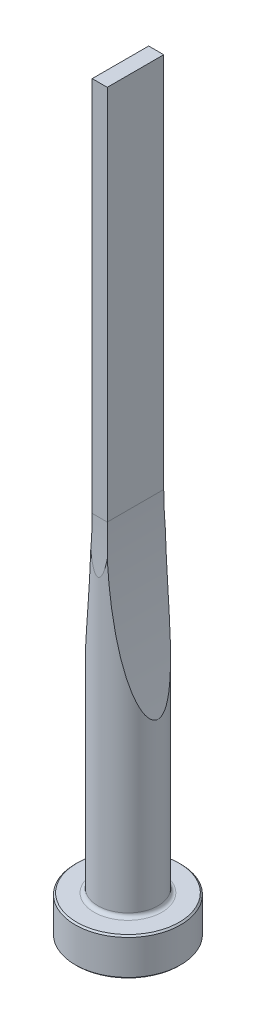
ISO-10303-21;
HEADER;
FILE_DESCRIPTION(('STEP AP214'),'2;1');
FILE_NAME('part.step','',(''),(''),'','','');
FILE_SCHEMA(('AUTOMOTIVE_DESIGN { 1 0 10303 214 1 1 1 1 }'));
ENDSEC;
DATA;
#1=APPLICATION_CONTEXT('core data for automotive mechanical design processes');
#2=APPLICATION_PROTOCOL_DEFINITION('international standard','automotive_design',2000,#1);
#3=PRODUCT_CONTEXT('',#1,'mechanical');
#4=PRODUCT('Part','Part','',(#3));
#5=PRODUCT_RELATED_PRODUCT_CATEGORY('part','',(#4));
#6=PRODUCT_DEFINITION_FORMATION('','',#4);
#7=PRODUCT_DEFINITION_CONTEXT('part definition',#1,'design');
#8=PRODUCT_DEFINITION('design','',#6,#7);
#9=PRODUCT_DEFINITION_SHAPE('','',#8);
#10=(LENGTH_UNIT() NAMED_UNIT(*) SI_UNIT(.MILLI.,.METRE.));
#11=(NAMED_UNIT(*) PLANE_ANGLE_UNIT() SI_UNIT($,.RADIAN.));
#12=(NAMED_UNIT(*) SI_UNIT($,.STERADIAN.) SOLID_ANGLE_UNIT());
#13=UNCERTAINTY_MEASURE_WITH_UNIT(LENGTH_MEASURE(1.E-05),#10,'distance_accuracy_value','');
#14=(GEOMETRIC_REPRESENTATION_CONTEXT(3) GLOBAL_UNCERTAINTY_ASSIGNED_CONTEXT((#13)) GLOBAL_UNIT_ASSIGNED_CONTEXT((#10,
#11,#12)) REPRESENTATION_CONTEXT('',''));
#15=CARTESIAN_POINT('',(0.,0.,0.));
#16=DIRECTION('',(0.,0.,1.));
#17=DIRECTION('',(1.,0.,0.));
#18=AXIS2_PLACEMENT_3D('',#15,#16,#17);
#19=CARTESIAN_POINT('',(0.,0.,0.));
#20=DIRECTION('',(0.,1.,0.));
#21=DIRECTION('',(-1.,0.,0.));
#22=AXIS2_PLACEMENT_3D('',#19,#20,#21);
#23=PLANE('',#22);
#24=CARTESIAN_POINT('',(0.,0.,0.));
#25=DIRECTION('',(0.,1.,0.));
#26=DIRECTION('',(-1.,0.,0.));
#27=AXIS2_PLACEMENT_3D('',#24,#25,#26);
#28=CIRCLE('',#27,6.8);
#29=CARTESIAN_POINT('',(-6.8,0.,0.));
#30=VERTEX_POINT('',#29);
#31=EDGE_CURVE('E133',#30,#30,#28,.T.);
#32=ORIENTED_EDGE('',*,*,#31,.F.);
#33=EDGE_LOOP('',(#32));
#34=FACE_BOUND('',#33,.T.);
#35=ADVANCED_FACE('F32',(#34),#23,.F.);
#36=CARTESIAN_POINT('',(0.,0.,0.));
#37=DIRECTION('',(0.,1.,0.));
#38=DIRECTION('',(-1.,0.,0.));
#39=AXIS2_PLACEMENT_3D('',#36,#37,#38);
#40=CONICAL_SURFACE('',#39,6.8,0.785398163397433);
#41=CARTESIAN_POINT('',(0.,0.200000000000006,0.));
#42=DIRECTION('',(0.,1.,0.));
#43=DIRECTION('',(-1.,0.,0.));
#44=AXIS2_PLACEMENT_3D('',#41,#42,#43);
#45=CIRCLE('',#44,7.);
#46=CARTESIAN_POINT('',(-7.,0.200000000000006,0.));
#47=VERTEX_POINT('',#46);
#48=EDGE_CURVE('E130',#47,#47,#45,.T.);
#49=ORIENTED_EDGE('',*,*,#48,.F.);
#50=EDGE_LOOP('',(#49));
#51=FACE_BOUND('',#50,.T.);
#52=ORIENTED_EDGE('',*,*,#31,.T.);
#53=EDGE_LOOP('',(#52));
#54=FACE_BOUND('',#53,.T.);
#55=ADVANCED_FACE('F171',(#51,#54),#40,.T.);
#56=CARTESIAN_POINT('',(0.,100.,0.));
#57=DIRECTION('',(0.,1.,0.));
#58=DIRECTION('',(-1.,0.,0.));
#59=AXIS2_PLACEMENT_3D('',#56,#57,#58);
#60=CYLINDRICAL_SURFACE('',#59,7.);
#61=CARTESIAN_POINT('',(0.,4.8,0.));
#62=DIRECTION('',(0.,1.,0.));
#63=DIRECTION('',(-1.,0.,0.));
#64=AXIS2_PLACEMENT_3D('',#61,#62,#63);
#65=CIRCLE('',#64,7.);
#66=CARTESIAN_POINT('',(-7.,4.8,0.));
#67=VERTEX_POINT('',#66);
#68=EDGE_CURVE('E127',#67,#67,#65,.T.);
#69=ORIENTED_EDGE('',*,*,#68,.F.);
#70=EDGE_LOOP('',(#69));
#71=FACE_BOUND('',#70,.T.);
#72=ORIENTED_EDGE('',*,*,#48,.T.);
#73=EDGE_LOOP('',(#72));
#74=FACE_BOUND('',#73,.T.);
#75=ADVANCED_FACE('F176',(#71,#74),#60,.T.);
#76=CARTESIAN_POINT('',(0.,4.8,0.));
#77=DIRECTION('',(0.,-1.,0.));
#78=DIRECTION('',(1.,0.,0.));
#79=AXIS2_PLACEMENT_3D('',#76,#77,#78);
#80=CONICAL_SURFACE('',#79,7.,0.785398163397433);
#81=CARTESIAN_POINT('',(0.,5.,0.));
#82=DIRECTION('',(0.,1.,0.));
#83=DIRECTION('',(-1.,0.,0.));
#84=AXIS2_PLACEMENT_3D('',#81,#82,#83);
#85=CIRCLE('',#84,6.8);
#86=CARTESIAN_POINT('',(-6.8,5.,0.));
#87=VERTEX_POINT('',#86);
#88=EDGE_CURVE('E124',#87,#87,#85,.T.);
#89=ORIENTED_EDGE('',*,*,#88,.F.);
#90=EDGE_LOOP('',(#89));
#91=FACE_BOUND('',#90,.T.);
#92=ORIENTED_EDGE('',*,*,#68,.T.);
#93=EDGE_LOOP('',(#92));
#94=FACE_BOUND('',#93,.T.);
#95=ADVANCED_FACE('F183',(#91,#94),#80,.T.);
#96=CARTESIAN_POINT('',(6.8,5.,0.));
#97=DIRECTION('',(0.,-1.,0.));
#98=DIRECTION('',(1.,0.,0.));
#99=AXIS2_PLACEMENT_3D('',#96,#97,#98);
#100=PLANE('',#99);
#101=CARTESIAN_POINT('',(0.,5.,0.));
#102=DIRECTION('',(0.,1.,0.));
#103=DIRECTION('',(-1.,0.,0.));
#104=AXIS2_PLACEMENT_3D('',#101,#102,#103);
#105=CIRCLE('',#104,4.50000000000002);
#106=CARTESIAN_POINT('',(-4.50000000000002,5.,0.));
#107=VERTEX_POINT('',#106);
#108=EDGE_CURVE('E121',#107,#107,#105,.T.);
#109=ORIENTED_EDGE('',*,*,#108,.F.);
#110=EDGE_LOOP('',(#109));
#111=FACE_BOUND('',#110,.T.);
#112=ORIENTED_EDGE('',*,*,#88,.T.);
#113=EDGE_LOOP('',(#112));
#114=FACE_BOUND('',#113,.T.);
#115=ADVANCED_FACE('F190',(#111,#114),#100,.F.);
#116=CARTESIAN_POINT('',(0.,5.5,0.));
#117=DIRECTION('',(0.,1.,0.));
#118=DIRECTION('',(-1.,0.,0.));
#119=AXIS2_PLACEMENT_3D('',#116,#117,#118);
#120=TOROIDAL_SURFACE('',#119,4.50000000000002,0.5);
#121=CARTESIAN_POINT('',(0.,5.50000000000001,0.));
#122=DIRECTION('',(0.,1.,0.));
#123=DIRECTION('',(-1.,0.,0.));
#124=AXIS2_PLACEMENT_3D('',#121,#122,#123);
#125=CIRCLE('',#124,4.00000000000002);
#126=CARTESIAN_POINT('',(-4.00000000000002,5.50000000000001,0.));
#127=VERTEX_POINT('',#126);
#128=EDGE_CURVE('E112',#127,#127,#125,.T.);
#129=ORIENTED_EDGE('',*,*,#128,.F.);
#130=EDGE_LOOP('',(#129));
#131=FACE_BOUND('',#130,.T.);
#132=ORIENTED_EDGE('',*,*,#108,.T.);
#133=EDGE_LOOP('',(#132));
#134=FACE_BOUND('',#133,.T.);
#135=ADVANCED_FACE('F168',(#131,#134),#120,.F.);
#136=CARTESIAN_POINT('',(0.,100.,0.));
#137=DIRECTION('',(0.,1.,0.));
#138=DIRECTION('',(-1.,0.,0.));
#139=AXIS2_PLACEMENT_3D('',#136,#137,#138);
#140=CYLINDRICAL_SURFACE('',#139,4.00000000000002);
#141=CARTESIAN_POINT('',(4.00000000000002,26.9565627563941,0.));
#142=CARTESIAN_POINT('',(3.99999908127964,26.9565661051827,0.0693234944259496));
#143=CARTESIAN_POINT('',(3.99817235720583,26.9634596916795,0.138657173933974));
#144=CARTESIAN_POINT('',(3.99114244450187,26.9900264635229,0.274681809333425));
#145=CARTESIAN_POINT('',(3.98593276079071,27.0097242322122,0.341367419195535));
#146=CARTESIAN_POINT('',(3.97135064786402,27.0649796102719,0.484371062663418));
#147=CARTESIAN_POINT('',(3.96131888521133,27.1030563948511,0.559625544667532));
#148=CARTESIAN_POINT('',(3.93842891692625,27.1902462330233,0.702905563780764));
#149=CARTESIAN_POINT('',(3.92556515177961,27.2393809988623,0.770916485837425));
#150=CARTESIAN_POINT('',(3.89970776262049,27.3385484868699,0.891965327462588));
#151=CARTESIAN_POINT('',(3.88693718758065,27.3876783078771,0.945808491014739));
#152=CARTESIAN_POINT('',(3.8603742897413,27.4902589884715,1.0489759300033));
#153=CARTESIAN_POINT('',(3.84658113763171,27.543713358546,1.09829646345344));
#154=CARTESIAN_POINT('',(3.81825138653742,27.6539498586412,1.19306609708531));
#155=CARTESIAN_POINT('',(3.80371318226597,27.710739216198,1.23850622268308));
#156=CARTESIAN_POINT('',(3.7741370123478,27.8267635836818,1.32590139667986));
#157=CARTESIAN_POINT('',(3.75909921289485,27.8859977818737,1.36785758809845));
#158=CARTESIAN_POINT('',(3.72120715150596,28.0359186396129,1.46859658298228));
#159=CARTESIAN_POINT('',(3.6981362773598,28.1277838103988,1.52554064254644));
#160=CARTESIAN_POINT('',(3.65154067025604,28.314614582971,1.63392905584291));
#161=CARTESIAN_POINT('',(3.62801571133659,28.4095817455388,1.68537058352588));
#162=CARTESIAN_POINT('',(3.58069701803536,28.6019791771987,1.78370145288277));
#163=CARTESIAN_POINT('',(3.55690289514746,28.6994133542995,1.83058291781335));
#164=CARTESIAN_POINT('',(3.50923075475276,28.8960774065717,1.92038432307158));
#165=CARTESIAN_POINT('',(3.4853527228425,28.9953076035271,1.96330354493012));
#166=CARTESIAN_POINT('',(3.41352667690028,29.2960810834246,2.08735367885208));
#167=CARTESIAN_POINT('',(3.36561636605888,29.4997748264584,2.16331575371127));
#168=CARTESIAN_POINT('',(3.29428173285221,29.8079687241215,2.26924886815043));
#169=CARTESIAN_POINT('',(3.27060420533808,29.9110877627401,2.30320927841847));
#170=CARTESIAN_POINT('',(3.22345187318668,30.118127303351,2.36875344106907));
#171=CARTESIAN_POINT('',(3.199977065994,30.2220477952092,2.40033722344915));
#172=CARTESIAN_POINT('',(3.1322258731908,30.5244895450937,2.48887679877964));
#173=CARTESIAN_POINT('',(3.08826162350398,30.7238941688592,2.54305671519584));
#174=CARTESIAN_POINT('',(3.00136468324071,31.1245602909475,2.64505001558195));
#175=CARTESIAN_POINT('',(2.95843214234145,31.3258220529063,2.69286248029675));
#176=CARTESIAN_POINT('',(2.87369595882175,31.7298832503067,2.78311065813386));
#177=CARTESIAN_POINT('',(2.83189286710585,31.9326833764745,2.82554378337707));
#178=CARTESIAN_POINT('',(2.74951474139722,32.3394527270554,2.90576401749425));
#179=CARTESIAN_POINT('',(2.70893977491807,32.5434220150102,2.94355087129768));
#180=CARTESIAN_POINT('',(2.58896832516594,33.1576796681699,3.05104054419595));
#181=CARTESIAN_POINT('',(2.51151492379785,33.5694143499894,3.1146769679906));
#182=CARTESIAN_POINT('',(2.36211591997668,34.3954588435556,3.22943230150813));
#183=CARTESIAN_POINT('',(2.29016893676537,34.8097679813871,3.28055435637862));
#184=CARTESIAN_POINT('',(2.15175693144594,35.6414535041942,3.37296310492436));
#185=CARTESIAN_POINT('',(2.08530598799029,36.0588349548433,3.41422502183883));
#186=CARTESIAN_POINT('',(1.95819345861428,36.8952058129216,3.48868104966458));
#187=CARTESIAN_POINT('',(1.89753217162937,37.3141953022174,3.52187474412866));
#188=CARTESIAN_POINT('',(1.78214714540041,38.152903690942,3.58164270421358));
#189=CARTESIAN_POINT('',(1.72741586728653,38.5726209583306,3.60822543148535));
#190=CARTESIAN_POINT('',(1.62384822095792,39.4130846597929,3.65600398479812));
#191=CARTESIAN_POINT('',(1.57501187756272,39.8338310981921,3.67719978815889));
#192=CARTESIAN_POINT('',(1.47580213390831,40.7446966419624,3.71824477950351));
#193=CARTESIAN_POINT('',(1.42647153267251,41.2349644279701,3.73731372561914));
#194=CARTESIAN_POINT('',(1.33585613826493,42.2164157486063,3.77065176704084));
#195=CARTESIAN_POINT('',(1.29457158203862,42.7075993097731,3.78492072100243));
#196=CARTESIAN_POINT('',(1.22006810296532,43.690730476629,3.80958961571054));
#197=CARTESIAN_POINT('',(1.1868501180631,44.1826781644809,3.81998910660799));
#198=CARTESIAN_POINT('',(1.1285011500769,45.1671100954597,3.83763118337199));
#199=CARTESIAN_POINT('',(1.10337020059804,45.6595943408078,3.84487375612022));
#200=CARTESIAN_POINT('',(1.06117886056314,46.6455641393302,3.85673174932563));
#201=CARTESIAN_POINT('',(1.04412872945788,47.1390501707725,3.86134383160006));
#202=CARTESIAN_POINT('',(1.01815247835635,48.1262528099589,3.86827428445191));
#203=CARTESIAN_POINT('',(1.00922637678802,48.6199694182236,3.87059264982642));
#204=CARTESIAN_POINT('',(0.999501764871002,49.6074463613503,3.87311520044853));
#205=CARTESIAN_POINT('',(0.998702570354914,50.101206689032,3.8733195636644));
#206=CARTESIAN_POINT('',(1.00523032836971,51.0886790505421,3.87163059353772));
#207=CARTESIAN_POINT('',(1.01255742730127,51.5823910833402,3.86973722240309));
#208=CARTESIAN_POINT('',(1.03528419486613,52.5673920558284,3.86371897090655));
#209=CARTESIAN_POINT('',(1.05064737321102,53.0586818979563,3.8596041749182));
#210=CARTESIAN_POINT('',(1.08941871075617,54.040907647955,3.84884036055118));
#211=CARTESIAN_POINT('',(1.11282671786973,54.531843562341,3.84219139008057));
#212=CARTESIAN_POINT('',(1.1676827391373,55.513290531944,3.82587724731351));
#213=CARTESIAN_POINT('',(1.19913195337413,56.0038015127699,3.81621162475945));
#214=CARTESIAN_POINT('',(1.27005463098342,56.9841557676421,3.79319818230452));
#215=CARTESIAN_POINT('',(1.30952805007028,57.4739990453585,3.77985038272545));
#216=CARTESIAN_POINT('',(1.39641875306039,58.4521583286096,3.74861904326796));
#217=CARTESIAN_POINT('',(1.44382502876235,58.9404755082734,3.73074177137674));
#218=CARTESIAN_POINT('',(1.54658814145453,59.9160306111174,3.68932757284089));
#219=CARTESIAN_POINT('',(1.6019448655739,60.4032685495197,3.66579072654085));
#220=CARTESIAN_POINT('',(1.72054689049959,61.3762642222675,3.61164347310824));
#221=CARTESIAN_POINT('',(1.78379011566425,61.8620223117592,3.58103492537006));
#222=CARTESIAN_POINT('',(1.91810188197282,62.8317964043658,3.51093205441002));
#223=CARTESIAN_POINT('',(1.9891698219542,63.3158125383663,3.47143841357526));
#224=CARTESIAN_POINT('',(2.10122535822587,64.0380393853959,3.40392660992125));
#225=CARTESIAN_POINT('',(2.13930667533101,64.2771044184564,3.38016662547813));
#226=CARTESIAN_POINT('',(2.21734164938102,64.7545955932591,3.32949919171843));
#227=CARTESIAN_POINT('',(2.25729529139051,64.9930217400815,3.30259176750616));
#228=CARTESIAN_POINT('',(2.33906610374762,65.4692337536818,3.24519121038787));
#229=CARTESIAN_POINT('',(2.38088409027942,65.7070192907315,3.21469649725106));
#230=CARTESIAN_POINT('',(2.46633098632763,66.1817058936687,3.1496185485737));
#231=CARTESIAN_POINT('',(2.50995988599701,66.418606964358,3.11503533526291));
#232=CARTESIAN_POINT('',(2.5992010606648,66.8925182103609,3.04097591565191));
#233=CARTESIAN_POINT('',(2.64482209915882,67.1295230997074,3.00147629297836));
#234=CARTESIAN_POINT('',(2.73777477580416,67.6022046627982,2.91693995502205));
#235=CARTESIAN_POINT('',(2.78510635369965,67.8378813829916,2.87190343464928));
#236=CARTESIAN_POINT('',(2.88134423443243,68.3073721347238,2.775338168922));
#237=CARTESIAN_POINT('',(2.93024917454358,68.5411875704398,2.72381493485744));
#238=CARTESIAN_POINT('',(3.02952417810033,69.006629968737,2.61295390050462));
#239=CARTESIAN_POINT('',(3.07989403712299,69.2382572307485,2.55361718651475));
#240=CARTESIAN_POINT('',(3.18241500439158,69.7009772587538,2.42468436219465));
#241=CARTESIAN_POINT('',(3.23457918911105,69.9320394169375,2.3549879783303));
#242=CARTESIAN_POINT('',(3.33990650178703,70.3902736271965,2.20309693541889));
#243=CARTESIAN_POINT('',(3.3930709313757,70.6174397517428,2.12088483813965));
#244=CARTESIAN_POINT('',(3.47273982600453,70.952130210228,1.98563598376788));
#245=CARTESIAN_POINT('',(3.49916049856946,71.062186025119,1.9388095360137));
#246=CARTESIAN_POINT('',(3.55191505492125,71.2801549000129,1.84038793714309));
#247=CARTESIAN_POINT('',(3.57824895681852,71.3880684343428,1.788793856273));
#248=CARTESIAN_POINT('',(3.63057497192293,71.6008227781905,1.68004710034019));
#249=CARTESIAN_POINT('',(3.65656774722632,71.7056702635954,1.62290788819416));
#250=CARTESIAN_POINT('',(3.70796358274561,71.9114488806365,1.50178061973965));
#251=CARTESIAN_POINT('',(3.733367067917,72.0123828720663,1.43779769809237));
#252=CARTESIAN_POINT('',(3.76958048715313,72.1552714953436,1.33841469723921));
#253=CARTESIAN_POINT('',(3.78081713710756,72.1994628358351,1.3063826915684));
#254=CARTESIAN_POINT('',(3.80299560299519,72.2864183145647,1.24033761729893));
#255=CARTESIAN_POINT('',(3.81393737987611,72.3291822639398,1.20632428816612));
#256=CARTESIAN_POINT('',(3.84622039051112,72.4549805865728,1.10091663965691));
#257=CARTESIAN_POINT('',(3.86700644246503,72.5354707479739,1.02618898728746));
#258=CARTESIAN_POINT('',(3.90290257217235,72.6737710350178,0.878722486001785));
#259=CARTESIAN_POINT('',(3.91838915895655,72.7331509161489,0.807567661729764));
#260=CARTESIAN_POINT('',(3.94649013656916,72.840522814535,0.656561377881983));
#261=CARTESIAN_POINT('',(3.95911214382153,72.8885450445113,0.576733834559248));
#262=CARTESIAN_POINT('',(3.97654860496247,72.9547310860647,0.436218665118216));
#263=CARTESIAN_POINT('',(3.98256540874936,72.9775199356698,0.377882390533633));
#264=CARTESIAN_POINT('',(3.99211051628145,73.0136376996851,0.25815529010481));
#265=CARTESIAN_POINT('',(3.99564216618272,73.0269793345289,0.196768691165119));
#266=CARTESIAN_POINT('',(3.99983907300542,73.0428312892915,0.0720803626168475));
#267=CARTESIAN_POINT('',(4.00048616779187,73.0452729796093,0.00876901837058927));
#268=CARTESIAN_POINT('',(3.99877838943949,73.0388247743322,-0.117242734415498));
#269=CARTESIAN_POINT('',(3.99642227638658,73.0299301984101,-0.179942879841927));
#270=CARTESIAN_POINT('',(3.98928141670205,73.0029350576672,-0.298132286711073));
#271=CARTESIAN_POINT('',(3.98469267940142,72.9855772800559,-0.353809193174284));
#272=CARTESIAN_POINT('',(3.97359466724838,72.943523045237,-0.46207223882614));
#273=CARTESIAN_POINT('',(3.96708467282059,72.9188238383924,-0.514657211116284));
#274=CARTESIAN_POINT('',(3.94721827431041,72.8432837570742,-0.653780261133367));
#275=CARTESIAN_POINT('',(3.93234499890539,72.7865658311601,-0.736891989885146));
#276=CARTESIAN_POINT('',(3.89976659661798,72.6617196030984,-0.893454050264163));
#277=CARTESIAN_POINT('',(3.88205151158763,72.5935511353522,-0.966868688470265));
#278=CARTESIAN_POINT('',(3.84515803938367,72.4508104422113,-1.10441932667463));
#279=CARTESIAN_POINT('',(3.82600386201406,72.3763422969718,-1.16867176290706));
#280=CARTESIAN_POINT('',(3.78663004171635,72.222385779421,-1.29055678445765));
#281=CARTESIAN_POINT('',(3.76640931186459,72.1428922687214,-1.34818241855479));
#282=CARTESIAN_POINT('',(3.72527346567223,71.9801994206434,-1.45800523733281));
#283=CARTESIAN_POINT('',(3.70435700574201,71.8969927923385,-1.51019100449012));
#284=CARTESIAN_POINT('',(3.66213788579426,71.7279873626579,-1.60986556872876));
#285=CARTESIAN_POINT('',(3.64083541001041,71.6421897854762,-1.65735654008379));
#286=CARTESIAN_POINT('',(3.58333461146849,71.4090933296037,-1.77958680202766));
#287=CARTESIAN_POINT('',(3.54693304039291,71.2599430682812,-1.85069466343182));
#288=CARTESIAN_POINT('',(3.47402617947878,70.9577698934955,-1.9841627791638));
#289=CARTESIAN_POINT('',(3.4375208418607,70.8047447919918,-2.04651795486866));
#290=CARTESIAN_POINT('',(3.36465781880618,70.495659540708,-2.16422609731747));
#291=CARTESIAN_POINT('',(3.32830054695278,70.3395941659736,-2.21956550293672));
#292=CARTESIAN_POINT('',(3.25599936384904,70.0253926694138,-2.32433091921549));
#293=CARTESIAN_POINT('',(3.2200555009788,69.867256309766,-2.37375624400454));
#294=CARTESIAN_POINT('',(3.1485349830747,69.5485779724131,-2.46784011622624));
#295=CARTESIAN_POINT('',(3.1129611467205,69.3880278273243,-2.51247298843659));
#296=CARTESIAN_POINT('',(3.04246152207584,69.0656407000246,-2.59739704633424));
#297=CARTESIAN_POINT('',(3.00753576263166,68.9038036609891,-2.63768803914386));
#298=CARTESIAN_POINT('',(2.93844678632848,68.5792983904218,-2.71444158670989));
#299=CARTESIAN_POINT('',(2.90428263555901,68.4166315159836,-2.75090905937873));
#300=CARTESIAN_POINT('',(2.83672091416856,68.0904386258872,-2.82052506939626));
#301=CARTESIAN_POINT('',(2.80332332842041,67.9269126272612,-2.8536736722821));
#302=CARTESIAN_POINT('',(2.70147864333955,67.4210437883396,-2.95146748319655));
#303=CARTESIAN_POINT('',(2.63437939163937,67.0774742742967,-3.01119821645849));
#304=CARTESIAN_POINT('',(2.50391772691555,66.3880012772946,-3.12051465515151));
#305=CARTESIAN_POINT('',(2.44055587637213,66.0420974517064,-3.17009883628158));
#306=CARTESIAN_POINT('',(2.31768945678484,65.3483533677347,-3.26100537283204));
#307=CARTESIAN_POINT('',(2.25818681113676,65.0005122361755,-3.30232362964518));
#308=CARTESIAN_POINT('',(2.14316659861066,64.303424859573,-3.3781021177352));
#309=CARTESIAN_POINT('',(2.08764916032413,63.9541785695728,-3.41256212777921));
#310=CARTESIAN_POINT('',(1.98054110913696,63.2537446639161,-3.47582142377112));
#311=CARTESIAN_POINT('',(1.92895986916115,62.9025544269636,-3.50460744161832));
#312=CARTESIAN_POINT('',(1.82991060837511,62.1992332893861,-3.55732520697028));
#313=CARTESIAN_POINT('',(1.78244263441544,61.8471023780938,-3.58125689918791));
#314=CARTESIAN_POINT('',(1.64628374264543,60.7897335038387,-3.64691345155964));
#315=CARTESIAN_POINT('',(1.56380501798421,60.0833047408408,-3.68251817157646));
#316=CARTESIAN_POINT('',(1.41559952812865,58.6683992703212,-3.74197834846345));
#317=CARTESIAN_POINT('',(1.34986900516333,57.9599230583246,-3.76583644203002));
#318=CARTESIAN_POINT('',(1.23521097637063,56.5413346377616,-3.80498659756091));
#319=CARTESIAN_POINT('',(1.18628456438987,55.8312223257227,-3.82027810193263));
#320=CARTESIAN_POINT('',(1.10533658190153,54.4107779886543,-3.84447711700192));
#321=CARTESIAN_POINT('',(1.07329506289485,53.700447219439,-3.85339216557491));
#322=CARTESIAN_POINT('',(1.02605523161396,52.2792045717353,-3.86624049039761));
#323=CARTESIAN_POINT('',(1.0108562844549,51.5682927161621,-3.87017395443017));
#324=CARTESIAN_POINT('',(0.999328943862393,50.3582263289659,-3.87315713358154));
#325=CARTESIAN_POINT('',(0.998726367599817,49.8591104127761,-3.87331302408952));
#326=CARTESIAN_POINT('',(1.00582442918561,48.8609418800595,-3.87147723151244));
#327=CARTESIAN_POINT('',(1.01352501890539,48.3618892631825,-3.86948556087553));
#328=CARTESIAN_POINT('',(1.0372296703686,47.3638725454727,-3.86319865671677));
#329=CARTESIAN_POINT('',(1.05323578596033,46.8649084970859,-3.85890285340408));
#330=CARTESIAN_POINT('',(1.093546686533,45.8673446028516,-3.84767388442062));
#331=CARTESIAN_POINT('',(1.11785146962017,45.368744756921,-3.84074071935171));
#332=CARTESIAN_POINT('',(1.17470614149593,44.3728367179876,-3.82373444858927));
#333=CARTESIAN_POINT('',(1.20724330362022,43.8755277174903,-3.81366618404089));
#334=CARTESIAN_POINT('',(1.2805658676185,42.8816121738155,-3.78967555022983));
#335=CARTESIAN_POINT('',(1.32135121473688,42.3850056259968,-3.77575320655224));
#336=CARTESIAN_POINT('',(1.41113931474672,41.3927858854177,-3.74312274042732));
#337=CARTESIAN_POINT('',(1.46014051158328,40.8971725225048,-3.72441552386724));
#338=CARTESIAN_POINT('',(1.56633082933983,39.9070977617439,-3.68101972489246));
#339=CARTESIAN_POINT('',(1.62351961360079,39.4126363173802,-3.65633138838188));
#340=CARTESIAN_POINT('',(1.72671298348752,38.5808823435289,-3.60840561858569));
#341=CARTESIAN_POINT('',(1.77055626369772,38.2432052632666,-3.58716639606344));
#342=CARTESIAN_POINT('',(1.86203181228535,37.5686496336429,-3.54054739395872));
#343=CARTESIAN_POINT('',(1.90966405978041,37.2317710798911,-3.51516763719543));
#344=CARTESIAN_POINT('',(2.00868306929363,36.5589765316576,-3.45954065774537));
#345=CARTESIAN_POINT('',(2.06006968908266,36.2230605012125,-3.4292936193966));
#346=CARTESIAN_POINT('',(2.16654882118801,35.5523963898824,-3.36303263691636));
#347=CARTESIAN_POINT('',(2.22164124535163,35.2176482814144,-3.32701882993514));
#348=CARTESIAN_POINT('',(2.35670095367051,34.4249595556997,-3.23342990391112));
#349=CARTESIAN_POINT('',(2.4382822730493,33.9676361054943,-3.1728227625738));
#350=CARTESIAN_POINT('',(2.56559466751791,33.2844482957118,-3.06931357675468));
#351=CARTESIAN_POINT('',(2.60885994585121,33.0571634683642,-3.03270663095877));
#352=CARTESIAN_POINT('',(2.69697844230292,32.6037443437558,-2.95461990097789));
#353=CARTESIAN_POINT('',(2.74183160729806,32.3776100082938,-2.91314027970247));
#354=CARTESIAN_POINT('',(2.85075538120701,31.8392572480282,-2.80731366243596));
#355=CARTESIAN_POINT('',(2.91552855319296,31.5276895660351,-2.74033948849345));
#356=CARTESIAN_POINT('',(3.04764143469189,30.9085715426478,-2.59263375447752));
#357=CARTESIAN_POINT('',(3.11497908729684,30.6010182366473,-2.51191304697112));
#358=CARTESIAN_POINT('',(3.23134949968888,30.082365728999,-2.3589467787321));
#359=CARTESIAN_POINT('',(3.27986780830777,29.8697932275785,-2.29132479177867));
#360=CARTESIAN_POINT('',(3.37766837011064,29.4482650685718,-2.1445755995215));
#361=CARTESIAN_POINT('',(3.42695189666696,29.2393170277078,-2.06542683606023));
#362=CARTESIAN_POINT('',(3.50323968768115,28.9208540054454,-1.93138787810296));
#363=CARTESIAN_POINT('',(3.53023270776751,28.8091350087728,-1.88173006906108));
#364=CARTESIAN_POINT('',(3.58405466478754,28.5881946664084,-1.77708328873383));
#365=CARTESIAN_POINT('',(3.6108836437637,28.4789726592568,-1.72209575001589));
#366=CARTESIAN_POINT('',(3.66405248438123,28.264212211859,-1.60586223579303));
#367=CARTESIAN_POINT('',(3.69039359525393,28.1586634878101,-1.54463600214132));
#368=CARTESIAN_POINT('',(3.74226306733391,27.9523556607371,-1.4143528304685));
#369=CARTESIAN_POINT('',(3.7677921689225,27.8515921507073,-1.34530330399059));
#370=CARTESIAN_POINT('',(3.81202336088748,27.6781962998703,-1.21334596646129));
#371=CARTESIAN_POINT('',(3.83100666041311,27.6041974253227,-1.15234628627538));
#372=CARTESIAN_POINT('',(3.86759286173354,27.4622762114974,-1.02286989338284));
#373=CARTESIAN_POINT('',(3.88519303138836,27.3943658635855,-0.954378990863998));
#374=CARTESIAN_POINT('',(3.91836097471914,27.266928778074,-0.807593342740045));
#375=CARTESIAN_POINT('',(3.93389645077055,27.2075343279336,-0.729173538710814));
#376=CARTESIAN_POINT('',(3.96115450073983,27.1036627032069,-0.562403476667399));
#377=CARTESIAN_POINT('',(3.97289362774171,27.0591207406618,-0.474098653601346));
#378=CARTESIAN_POINT('',(3.98760341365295,27.003405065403,-0.320570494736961));
#379=CARTESIAN_POINT('',(3.9921998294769,26.9860292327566,-0.25778157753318));
#380=CARTESIAN_POINT('',(3.99839643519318,26.9626145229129,-0.129995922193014));
#381=CARTESIAN_POINT('',(4.00000086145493,26.9565596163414,-0.0650024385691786));
#382=CARTESIAN_POINT('',(4.00000000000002,26.9565627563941,0.));
#383=B_SPLINE_CURVE_WITH_KNOTS('',3,(#141,#142,#143,#144,#145,#146,#147,#148,#149,#150,#151,
#152,#153,#154,#155,#156,#157,#158,#159,#160,#161,#162,#163,#164,#165,#166,#167,#168,#169,#170,
#171,#172,#173,#174,#175,#176,#177,#178,#179,#180,#181,#182,#183,#184,#185,#186,#187,#188,#189,
#190,#191,#192,#193,#194,#195,#196,#197,#198,#199,#200,#201,#202,#203,#204,#205,#206,#207,#208,
#209,#210,#211,#212,#213,#214,#215,#216,#217,#218,#219,#220,#221,#222,#223,#224,#225,#226,#227,
#228,#229,#230,#231,#232,#233,#234,#235,#236,#237,#238,#239,#240,#241,#242,#243,#244,#245,#246,
#247,#248,#249,#250,#251,#252,#253,#254,#255,#256,#257,#258,#259,#260,#261,#262,#263,#264,#265,
#266,#267,#268,#269,#270,#271,#272,#273,#274,#275,#276,#277,#278,#279,#280,#281,#282,#283,#284,
#285,#286,#287,#288,#289,#290,#291,#292,#293,#294,#295,#296,#297,#298,#299,#300,#301,#302,#303,
#304,#305,#306,#307,#308,#309,#310,#311,#312,#313,#314,#315,#316,#317,#318,#319,#320,#321,#322,
#323,#324,#325,#326,#327,#328,#329,#330,#331,#332,#333,#334,#335,#336,#337,#338,#339,#340,#341,
#342,#343,#344,#345,#346,#347,#348,#349,#350,#351,#352,#353,#354,#355,#356,#357,#358,#359,#360,
#361,#362,#363,#364,#365,#366,#367,#368,#369,#370,#371,#372,#373,#374,#375,#376,#377,#378,#379,
#380,#381,#382),.UNSPECIFIED.,.T.,.F.,(4,2,2,2,2,2,2,2,2,2,2,2,2,2,2,2,2,2,2,2,2,2,2,2,2,2,2,2,
2,2,2,2,2,2,2,2,2,2,2,2,2,2,2,2,2,2,2,2,2,2,2,2,2,2,2,2,2,2,2,2,2,2,2,2,2,2,2,2,2,2,2,2,2,2,2,2,
2,2,2,2,2,2,2,2,2,2,2,2,2,2,2,2,2,2,2,2,2,2,2,2,2,2,2,2,2,2,2,2,2,2,2,2,2,2,2,2,2,2,2,2,4),(0.,
0.207654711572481,0.415709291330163,0.669058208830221,0.922908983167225,1.14458973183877,
1.36645227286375,1.58881477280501,1.81110402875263,2.14240740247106,2.47388012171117,
2.80591559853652,3.13801116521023,3.80539132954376,4.13873386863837,4.47207219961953,
5.10570938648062,5.73943795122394,6.37347024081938,7.00753732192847,8.27850002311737,
9.54914297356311,10.8229460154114,12.0968147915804,13.3690446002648,14.6412797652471,
16.120517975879,17.599799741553,19.0792534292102,20.5587132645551,22.0400464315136,
23.5213829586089,25.0025947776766,26.4838332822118,27.9584034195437,29.4329456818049,
30.9077081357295,32.3824624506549,33.8551870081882,35.3278906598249,36.8002075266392,
38.272411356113,39.0021153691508,39.7318135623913,40.4618344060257,41.1918512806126,
41.9254887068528,42.6591003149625,43.3920927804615,44.1249834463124,44.8654956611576,
45.6070492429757,45.9744252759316,46.3417190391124,46.7081423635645,47.0742926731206,
47.2414153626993,47.4085600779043,47.7430365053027,48.0241616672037,48.3045303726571,
48.4925925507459,48.680401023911,48.8693903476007,49.0584577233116,49.2333036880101,
49.4082152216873,49.7115824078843,50.0160368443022,50.3161898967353,50.616654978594,
50.9177385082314,51.2186819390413,51.7258716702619,52.2333544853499,52.7418037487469,
53.2503119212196,53.7614211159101,54.2725530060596,54.7830191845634,55.2934752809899,
56.3585947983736,57.4238742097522,58.4896805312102,59.5555212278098,60.6238254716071,
61.692141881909,63.8281212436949,65.9636209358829,68.0992596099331,70.2323694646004,
72.3653989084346,73.8626801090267,75.3599526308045,76.8575955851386,78.3552381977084,
79.8505795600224,81.3459109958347,82.840959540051,84.3359466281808,85.3594253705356,
86.3828984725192,87.4063328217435,88.4297428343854,89.8348427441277,90.5375282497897,
91.2401902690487,92.2155496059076,93.1901424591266,93.8747780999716,94.5607110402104,
94.9362132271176,95.3116147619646,95.685863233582,96.0597600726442,96.3526877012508,
96.646180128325,96.9438272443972,97.2401584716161,97.4351459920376,97.629857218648),.UNSPECIFIED.);
#384=CARTESIAN_POINT('',(1.09671499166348,45.8287478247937,-3.84671499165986));
#385=VERTEX_POINT('',#384);
#386=CARTESIAN_POINT('',(1.09671499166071,45.8287478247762,3.84671499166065));
#387=VERTEX_POINT('',#386);
#388=EDGE_CURVE('E138',#385,#387,#383,.T.);
#389=ORIENTED_EDGE('',*,*,#388,.T.);
#390=CARTESIAN_POINT('',(-1.39194109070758,50.,3.74999999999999));
#391=CARTESIAN_POINT('',(-1.39194449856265,50.3340996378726,3.7500000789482));
#392=CARTESIAN_POINT('',(-1.38695792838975,50.6682096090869,3.75186098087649));
#393=CARTESIAN_POINT('',(-1.36667392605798,51.3360771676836,3.75929815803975));
#394=CARTESIAN_POINT('',(-1.35137656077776,51.6698347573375,3.76487440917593));
#395=CARTESIAN_POINT('',(-1.30923320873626,52.3374065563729,3.7797366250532));
#396=CARTESIAN_POINT('',(-1.28235776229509,52.6712187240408,3.78903204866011));
#397=CARTESIAN_POINT('',(-1.21470251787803,53.3371930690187,3.81127649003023));
#398=CARTESIAN_POINT('',(-1.17393087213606,53.6693560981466,3.82422336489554));
#399=CARTESIAN_POINT('',(-1.09844611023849,54.1657630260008,3.84630718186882));
#400=CARTESIAN_POINT('',(-1.0708504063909,54.3311442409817,3.85412453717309));
#401=CARTESIAN_POINT('',(-1.00961852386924,54.6608992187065,3.87061811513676));
#402=CARTESIAN_POINT('',(-0.97597724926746,54.8252720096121,3.87929505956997));
#403=CARTESIAN_POINT('',(-0.900897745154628,55.1517938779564,3.8974227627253));
#404=CARTESIAN_POINT('',(-0.859480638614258,55.3139477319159,3.90687138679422));
#405=CARTESIAN_POINT('',(-0.788768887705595,55.5545158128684,3.92153114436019));
#406=CARTESIAN_POINT('',(-0.763786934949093,55.6342087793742,3.92649537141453));
#407=CARTESIAN_POINT('',(-0.710141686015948,55.7923268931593,3.93655330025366));
#408=CARTESIAN_POINT('',(-0.681479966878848,55.8707525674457,3.9416469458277));
#409=CARTESIAN_POINT('',(-0.619110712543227,56.0259141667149,3.9519241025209));
#410=CARTESIAN_POINT('',(-0.585384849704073,56.1026427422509,3.95710787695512));
#411=CARTESIAN_POINT('',(-0.510918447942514,56.2524891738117,3.9674185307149));
#412=CARTESIAN_POINT('',(-0.470205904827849,56.3256199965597,3.97254555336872));
#413=CARTESIAN_POINT('',(-0.405871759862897,56.4217687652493,3.97939443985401));
#414=CARTESIAN_POINT('',(-0.38710072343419,56.4479908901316,3.98127456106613));
#415=CARTESIAN_POINT('',(-0.347340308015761,56.4988380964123,3.98494137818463));
#416=CARTESIAN_POINT('',(-0.326345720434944,56.5234591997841,3.98672783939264));
#417=CARTESIAN_POINT('',(-0.281381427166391,56.570454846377,3.99015550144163));
#418=CARTESIAN_POINT('',(-0.257378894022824,56.5927987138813,3.99179469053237));
#419=CARTESIAN_POINT('',(-0.206002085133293,56.6332343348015,3.99477391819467));
#420=CARTESIAN_POINT('',(-0.178643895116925,56.6513452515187,3.99611530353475));
#421=CARTESIAN_POINT('',(-0.133196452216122,56.6742305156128,3.99781497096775));
#422=CARTESIAN_POINT('',(-0.116315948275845,56.681368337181,3.99834625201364));
#423=CARTESIAN_POINT('',(-0.0816311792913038,56.6928863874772,3.99920443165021));
#424=CARTESIAN_POINT('',(-0.0638281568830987,56.6972702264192,3.99953159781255));
#425=CARTESIAN_POINT('',(-0.0275781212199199,56.7028240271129,3.99994619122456));
#426=CARTESIAN_POINT('',(-0.00912739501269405,56.7039706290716,4.00003187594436));
#427=CARTESIAN_POINT('',(0.0276703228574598,56.7028293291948,3.99994663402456));
#428=CARTESIAN_POINT('',(0.0460172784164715,56.700540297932,3.999775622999));
#429=CARTESIAN_POINT('',(0.0805943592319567,56.6931273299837,3.99922251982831));
#430=CARTESIAN_POINT('',(0.0968774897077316,56.6882404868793,3.99885808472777));
#431=CARTESIAN_POINT('',(0.128581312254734,56.6762358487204,3.99796430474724));
#432=CARTESIAN_POINT('',(0.14400167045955,56.6691171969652,3.99743489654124));
#433=CARTESIAN_POINT('',(0.18500697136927,56.6471511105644,3.99580470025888));
#434=CARTESIAN_POINT('',(0.209611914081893,56.6304953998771,3.99457196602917));
#435=CARTESIAN_POINT('',(0.256071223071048,56.5937200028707,3.99186273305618));
#436=CARTESIAN_POINT('',(0.277915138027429,56.5735877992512,3.99038535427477));
#437=CARTESIAN_POINT('',(0.350665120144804,56.499085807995,3.98494736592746));
#438=CARTESIAN_POINT('',(0.3955528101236,56.4389897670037,3.98061079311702));
#439=CARTESIAN_POINT('',(0.476792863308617,56.3133434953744,3.97168524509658));
#440=CARTESIAN_POINT('',(0.513090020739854,56.2477614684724,3.967094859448));
#441=CARTESIAN_POINT('',(0.605299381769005,56.0631758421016,3.95438947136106));
#442=CARTESIAN_POINT('',(0.655314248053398,55.9412436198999,3.94623160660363));
#443=CARTESIAN_POINT('',(0.745376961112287,55.6936668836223,3.93019294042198));
#444=CARTESIAN_POINT('',(0.785397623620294,55.5680132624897,3.92231294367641));
#445=CARTESIAN_POINT('',(0.858576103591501,55.314360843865,3.90694950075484));
#446=CARTESIAN_POINT('',(0.891716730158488,55.1863570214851,3.89946708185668));
#447=CARTESIAN_POINT('',(0.952763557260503,54.9292949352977,3.88499773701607));
#448=CARTESIAN_POINT('',(0.980676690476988,54.8002383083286,3.87801016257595));
#449=CARTESIAN_POINT('',(1.05809609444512,54.4130670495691,3.85789047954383));
#450=CARTESIAN_POINT('',(1.10161068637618,54.1537155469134,3.84552636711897));
#451=CARTESIAN_POINT('',(1.17739914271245,53.6332486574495,3.82298810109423));
#452=CARTESIAN_POINT('',(1.20966805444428,53.3721325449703,3.81281491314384));
#453=CARTESIAN_POINT('',(1.26533785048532,52.8484213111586,3.79470411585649));
#454=CARTESIAN_POINT('',(1.28872293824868,52.5858243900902,3.78677049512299));
#455=CARTESIAN_POINT('',(1.3279421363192,52.0599951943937,3.77319404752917));
#456=CARTESIAN_POINT('',(1.3437755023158,51.796762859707,3.7675514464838));
#457=CARTESIAN_POINT('',(1.36866096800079,51.2703935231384,3.75858225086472));
#458=CARTESIAN_POINT('',(1.37772460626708,51.007257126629,3.75525171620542));
#459=CARTESIAN_POINT('',(1.38952938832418,50.4808229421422,3.75089945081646));
#460=CARTESIAN_POINT('',(1.39227046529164,50.2175251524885,3.74987774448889));
#461=CARTESIAN_POINT('',(1.39154941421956,49.6912325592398,3.75014538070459));
#462=CARTESIAN_POINT('',(1.3880941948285,49.4282377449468,3.75143214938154));
#463=CARTESIAN_POINT('',(1.3748439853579,48.90243755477,3.75630869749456));
#464=CARTESIAN_POINT('',(1.36504925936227,48.6396321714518,3.75989838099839));
#465=CARTESIAN_POINT('',(1.33880225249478,48.1170444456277,3.76932382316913));
#466=CARTESIAN_POINT('',(1.3224180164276,47.8572583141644,3.77513659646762));
#467=CARTESIAN_POINT('',(1.28217391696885,47.3382024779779,3.78899593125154));
#468=CARTESIAN_POINT('',(1.2583109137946,47.0789330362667,3.79704343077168));
#469=CARTESIAN_POINT('',(1.20163024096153,46.5608244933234,3.81536023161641));
#470=CARTESIAN_POINT('',(1.16879164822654,46.3019878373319,3.82563471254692));
#471=CARTESIAN_POINT('',(1.09180587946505,45.7862363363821,3.8483276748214));
#472=CARTESIAN_POINT('',(1.04766828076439,45.5293200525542,3.86074433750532));
#473=CARTESIAN_POINT('',(0.969147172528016,45.145796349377,3.88091053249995));
#474=CARTESIAN_POINT('',(0.94082661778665,45.0179166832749,3.88791072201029));
#475=CARTESIAN_POINT('',(0.878848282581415,44.7632801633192,3.90238986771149));
#476=CARTESIAN_POINT('',(0.845183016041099,44.6365251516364,3.90986948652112));
#477=CARTESIAN_POINT('',(0.7708395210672,44.3854811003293,3.9252100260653));
#478=CARTESIAN_POINT('',(0.73018499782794,44.2611852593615,3.93306959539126));
#479=CARTESIAN_POINT('',(0.661250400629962,44.0778844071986,3.94503185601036));
#480=CARTESIAN_POINT('',(0.636977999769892,44.0173732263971,3.94904355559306));
#481=CARTESIAN_POINT('',(0.584962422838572,43.8978769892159,3.95708454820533));
#482=CARTESIAN_POINT('',(0.557221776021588,43.8388908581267,3.96111382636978));
#483=CARTESIAN_POINT('',(0.496796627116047,43.7229032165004,3.96914753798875));
#484=CARTESIAN_POINT('',(0.464075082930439,43.6659208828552,3.97315152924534));
#485=CARTESIAN_POINT('',(0.391808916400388,43.5565882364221,3.98093309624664));
#486=CARTESIAN_POINT('',(0.352311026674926,43.5042096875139,3.98471199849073));
#487=CARTESIAN_POINT('',(0.291384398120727,43.4398387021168,3.98940404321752));
#488=CARTESIAN_POINT('',(0.274626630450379,43.4235001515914,3.9905999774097));
#489=CARTESIAN_POINT('',(0.23943399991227,43.3926348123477,3.99286679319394));
#490=CARTESIAN_POINT('',(0.22099654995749,43.37811090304,3.99393747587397));
#491=CARTESIAN_POINT('',(0.1820380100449,43.351512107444,3.99590377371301));
#492=CARTESIAN_POINT('',(0.161493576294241,43.3394704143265,3.99679701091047));
#493=CARTESIAN_POINT('',(0.118575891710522,43.3192603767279,3.99829905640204));
#494=CARTESIAN_POINT('',(0.0962092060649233,43.3110787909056,3.99890883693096));
#495=CARTESIAN_POINT('',(0.0565412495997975,43.3013407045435,3.99963520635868));
#496=CARTESIAN_POINT('',(0.0395386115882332,43.2985809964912,3.99984131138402));
#497=CARTESIAN_POINT('',(0.00530985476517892,43.296014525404,4.00003297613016));
#498=CARTESIAN_POINT('',(-0.0119161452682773,43.2962062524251,4.00001864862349));
#499=CARTESIAN_POINT('',(-0.0460423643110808,43.2995172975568,3.99977139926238));
#500=CARTESIAN_POINT('',(-0.0629431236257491,43.3026312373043,3.99953887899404));
#501=CARTESIAN_POINT('',(-0.0960472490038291,43.3114519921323,3.99888109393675));
#502=CARTESIAN_POINT('',(-0.112249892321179,43.3171614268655,3.99845563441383));
#503=CARTESIAN_POINT('',(-0.151566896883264,43.3340811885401,3.99719710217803));
#504=CARTESIAN_POINT('',(-0.174103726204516,43.3466149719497,3.99626655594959));
#505=CARTESIAN_POINT('',(-0.216979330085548,43.3749765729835,3.9941686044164));
#506=CARTESIAN_POINT('',(-0.237311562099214,43.3908138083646,3.99300052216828));
#507=CARTESIAN_POINT('',(-0.293164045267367,43.4396828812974,3.98941150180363));
#508=CARTESIAN_POINT('',(-0.326182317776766,43.4755180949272,3.98679738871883));
#509=CARTESIAN_POINT('',(-0.387204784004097,43.5511526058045,3.98133154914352));
#510=CARTESIAN_POINT('',(-0.415192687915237,43.5909641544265,3.97847909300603));
#511=CARTESIAN_POINT('',(-0.485402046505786,43.7007934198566,3.97068874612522));
#512=CARTESIAN_POINT('',(-0.524314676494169,43.7728961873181,3.96565520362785));
#513=CARTESIAN_POINT('',(-0.595699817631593,43.9202694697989,3.95555476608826));
#514=CARTESIAN_POINT('',(-0.628155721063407,43.9955475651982,3.95048781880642));
#515=CARTESIAN_POINT('',(-0.68860589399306,44.1483373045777,3.94040179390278));
#516=CARTESIAN_POINT('',(-0.71657513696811,44.225858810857,3.93538312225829));
#517=CARTESIAN_POINT('',(-0.76895003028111,44.3819705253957,3.92548292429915));
#518=CARTESIAN_POINT('',(-0.793360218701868,44.4605592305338,3.92060122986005));
#519=CARTESIAN_POINT('',(-0.867663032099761,44.7152944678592,3.90511793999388));
#520=CARTESIAN_POINT('',(-0.912146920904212,44.8930332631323,3.89483400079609));
#521=CARTESIAN_POINT('',(-0.992112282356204,45.2506061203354,3.87522370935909));
#522=CARTESIAN_POINT('',(-1.02758760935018,45.430441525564,3.86589801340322));
#523=CARTESIAN_POINT('',(-1.0918042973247,45.7917615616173,3.84825637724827));
#524=CARTESIAN_POINT('',(-1.12053061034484,45.9732489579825,3.83994271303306));
#525=CARTESIAN_POINT('',(-1.17251616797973,46.3370581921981,3.82438612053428));
#526=CARTESIAN_POINT('',(-1.19577469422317,46.5193801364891,3.81714333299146));
#527=CARTESIAN_POINT('',(-1.2586638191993,47.0667778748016,3.79707123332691));
#528=CARTESIAN_POINT('',(-1.29147691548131,47.4327013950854,3.78587783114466));
#529=CARTESIAN_POINT('',(-1.34282300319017,48.1651770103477,3.76795987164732));
#530=CARTESIAN_POINT('',(-1.36137252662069,48.5317278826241,3.76123014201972));
#531=CARTESIAN_POINT('',(-1.37978686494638,49.0820898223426,3.75449366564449));
#532=CARTESIAN_POINT('',(-1.38435657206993,49.2657354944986,3.75280785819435));
#533=CARTESIAN_POINT('',(-1.3904313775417,49.6329197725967,3.75056150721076));
#534=CARTESIAN_POINT('',(-1.39193921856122,49.8164583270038,3.74999995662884));
#535=CARTESIAN_POINT('',(-1.39194109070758,50.,3.74999999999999));
#536=B_SPLINE_CURVE_WITH_KNOTS('',3,(#390,#391,#392,#393,#394,#395,#396,#397,#398,#399,#400,
#401,#402,#403,#404,#405,#406,#407,#408,#409,#410,#411,#412,#413,#414,#415,#416,#417,#418,#419,
#420,#421,#422,#423,#424,#425,#426,#427,#428,#429,#430,#431,#432,#433,#434,#435,#436,#437,#438,
#439,#440,#441,#442,#443,#444,#445,#446,#447,#448,#449,#450,#451,#452,#453,#454,#455,#456,#457,
#458,#459,#460,#461,#462,#463,#464,#465,#466,#467,#468,#469,#470,#471,#472,#473,#474,#475,#476,
#477,#478,#479,#480,#481,#482,#483,#484,#485,#486,#487,#488,#489,#490,#491,#492,#493,#494,#495,
#496,#497,#498,#499,#500,#501,#502,#503,#504,#505,#506,#507,#508,#509,#510,#511,#512,#513,#514,
#515,#516,#517,#518,#519,#520,#521,#522,#523,#524,#525,#526,#527,#528,#529,#530,#531,#532,#533,
#534,#535),.UNSPECIFIED.,.T.,.F.,(4,2,2,2,2,2,2,2,2,2,2,2,2,2,2,2,2,2,2,2,2,2,2,2,2,2,2,2,2,2,2,
2,2,2,2,2,2,2,2,2,2,2,2,2,2,2,2,2,2,2,2,2,2,2,2,2,2,2,2,2,2,2,2,2,2,2,2,2,2,2,2,2,4),(0.,
1.00227413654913,2.00454177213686,3.00937481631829,4.01361938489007,4.51708131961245,
5.02096963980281,5.52350845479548,5.77444116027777,6.0252666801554,6.2770228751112,
6.52779287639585,6.62462106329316,6.72168130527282,6.8199121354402,6.91768924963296,
6.97250700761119,7.02725275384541,7.08239254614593,7.13755046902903,7.18837076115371,
7.23921058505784,7.32790198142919,7.41691964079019,7.64058495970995,7.86565080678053,
8.26074626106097,8.65690494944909,9.05404189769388,9.45064837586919,10.2400274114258,
11.0297536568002,11.8208776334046,12.6120795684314,13.4019298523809,14.1917884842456,
14.980766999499,15.7697126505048,16.5507124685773,17.3320406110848,18.1152058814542,
18.8977095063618,19.2911173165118,19.6850810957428,20.077734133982,20.2736272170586,
20.4693782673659,20.6666634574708,20.8626390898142,20.9328478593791,21.0031666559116,
21.074372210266,21.1453316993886,21.1967759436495,21.2481938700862,21.2995173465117,
21.3508927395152,21.4278600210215,21.5050498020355,21.6506217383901,21.7966569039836,
22.0422774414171,22.2885218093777,22.536095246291,22.7833501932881,23.3334505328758,
23.8839251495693,24.43561572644,24.9873787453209,26.0896404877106,27.1906227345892,
27.7417280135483,28.2923394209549),.UNSPECIFIED.);
#537=CARTESIAN_POINT('',(-1.09671499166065,45.8287478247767,3.84671499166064));
#538=VERTEX_POINT('',#537);
#539=EDGE_CURVE('E104',#387,#538,#536,.T.);
#540=ORIENTED_EDGE('',*,*,#539,.T.);
#541=CARTESIAN_POINT('',(-4.00000000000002,26.9565627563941,0.));
#542=CARTESIAN_POINT('',(-3.99999908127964,26.9565661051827,-0.0693234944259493));
#543=CARTESIAN_POINT('',(-3.99817235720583,26.9634596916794,-0.138657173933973));
#544=CARTESIAN_POINT('',(-3.99114244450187,26.9900264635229,-0.274681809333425));
#545=CARTESIAN_POINT('',(-3.98593276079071,27.0097242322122,-0.341367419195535));
#546=CARTESIAN_POINT('',(-3.97135064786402,27.0649796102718,-0.484371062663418));
#547=CARTESIAN_POINT('',(-3.96131888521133,27.1030563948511,-0.559625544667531));
#548=CARTESIAN_POINT('',(-3.93842891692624,27.1902462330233,-0.702905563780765));
#549=CARTESIAN_POINT('',(-3.92556515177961,27.2393809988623,-0.770916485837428));
#550=CARTESIAN_POINT('',(-3.89970776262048,27.3385484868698,-0.891965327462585));
#551=CARTESIAN_POINT('',(-3.88693718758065,27.3876783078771,-0.945808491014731));
#552=CARTESIAN_POINT('',(-3.8603742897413,27.4902589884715,-1.04897593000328));
#553=CARTESIAN_POINT('',(-3.84658113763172,27.543713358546,-1.09829646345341));
#554=CARTESIAN_POINT('',(-3.81825138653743,27.6539498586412,-1.19306609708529));
#555=CARTESIAN_POINT('',(-3.80371318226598,27.710739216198,-1.23850622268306));
#556=CARTESIAN_POINT('',(-3.7741370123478,27.8267635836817,-1.32590139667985));
#557=CARTESIAN_POINT('',(-3.75909921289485,27.8859977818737,-1.36785758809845));
#558=CARTESIAN_POINT('',(-3.72120715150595,28.0359186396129,-1.46859658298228));
#559=CARTESIAN_POINT('',(-3.6981362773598,28.1277838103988,-1.52554064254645));
#560=CARTESIAN_POINT('',(-3.65154067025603,28.314614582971,-1.63392905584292));
#561=CARTESIAN_POINT('',(-3.62801571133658,28.4095817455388,-1.68537058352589));
#562=CARTESIAN_POINT('',(-3.58069701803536,28.6019791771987,-1.78370145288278));
#563=CARTESIAN_POINT('',(-3.55690289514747,28.6994133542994,-1.83058291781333));
#564=CARTESIAN_POINT('',(-3.50923075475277,28.8960774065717,-1.92038432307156));
#565=CARTESIAN_POINT('',(-3.4853527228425,28.9953076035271,-1.96330354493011));
#566=CARTESIAN_POINT('',(-3.41352667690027,29.2960810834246,-2.08735367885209));
#567=CARTESIAN_POINT('',(-3.36561636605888,29.4997748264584,-2.16331575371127));
#568=CARTESIAN_POINT('',(-3.29428173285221,29.8079687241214,-2.26924886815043));
#569=CARTESIAN_POINT('',(-3.27060420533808,29.91108776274,-2.30320927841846));
#570=CARTESIAN_POINT('',(-3.22345187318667,30.118127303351,-2.36875344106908));
#571=CARTESIAN_POINT('',(-3.19997706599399,30.2220477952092,-2.40033722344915));
#572=CARTESIAN_POINT('',(-3.1322258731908,30.5244895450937,-2.48887679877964));
#573=CARTESIAN_POINT('',(-3.08826162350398,30.7238941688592,-2.54305671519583));
#574=CARTESIAN_POINT('',(-3.00136468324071,31.1245602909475,-2.64505001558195));
#575=CARTESIAN_POINT('',(-2.95843214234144,31.3258220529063,-2.69286248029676));
#576=CARTESIAN_POINT('',(-2.87369595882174,31.7298832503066,-2.78311065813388));
#577=CARTESIAN_POINT('',(-2.83189286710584,31.9326833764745,-2.82554378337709));
#578=CARTESIAN_POINT('',(-2.74951474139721,32.3394527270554,-2.90576401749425));
#579=CARTESIAN_POINT('',(-2.70893977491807,32.5434220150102,-2.94355087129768));
#580=CARTESIAN_POINT('',(-2.58896832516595,33.1576796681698,-3.05104054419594));
#581=CARTESIAN_POINT('',(-2.51151492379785,33.5694143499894,-3.11467696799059));
#582=CARTESIAN_POINT('',(-2.36211591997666,34.3954588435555,-3.22943230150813));
#583=CARTESIAN_POINT('',(-2.29016893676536,34.809767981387,-3.28055435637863));
#584=CARTESIAN_POINT('',(-2.15175693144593,35.6414535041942,-3.37296310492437));
#585=CARTESIAN_POINT('',(-2.08530598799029,36.0588349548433,-3.41422502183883));
#586=CARTESIAN_POINT('',(-1.95819345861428,36.8952058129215,-3.48868104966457));
#587=CARTESIAN_POINT('',(-1.89753217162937,37.3141953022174,-3.52187474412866));
#588=CARTESIAN_POINT('',(-1.78214714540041,38.152903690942,-3.58164270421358));
#589=CARTESIAN_POINT('',(-1.72741586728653,38.5726209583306,-3.60822543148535));
#590=CARTESIAN_POINT('',(-1.62384822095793,39.4130846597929,-3.65600398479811));
#591=CARTESIAN_POINT('',(-1.57501187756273,39.8338310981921,-3.67719978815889));
#592=CARTESIAN_POINT('',(-1.47580213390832,40.7446966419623,-3.7182447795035));
#593=CARTESIAN_POINT('',(-1.4264715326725,41.2349644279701,-3.73731372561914));
#594=CARTESIAN_POINT('',(-1.33585613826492,42.2164157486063,-3.77065176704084));
#595=CARTESIAN_POINT('',(-1.29457158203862,42.7075993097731,-3.78492072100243));
#596=CARTESIAN_POINT('',(-1.22006810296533,43.690730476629,-3.80958961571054));
#597=CARTESIAN_POINT('',(-1.18685011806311,44.1826781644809,-3.81998910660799));
#598=CARTESIAN_POINT('',(-1.12850115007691,45.1671100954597,-3.83763118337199));
#599=CARTESIAN_POINT('',(-1.10337020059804,45.6595943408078,-3.84487375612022));
#600=CARTESIAN_POINT('',(-1.06117886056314,46.6455641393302,-3.85673174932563));
#601=CARTESIAN_POINT('',(-1.04412872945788,47.1390501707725,-3.86134383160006));
#602=CARTESIAN_POINT('',(-1.01815247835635,48.126252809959,-3.86827428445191));
#603=CARTESIAN_POINT('',(-1.00922637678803,48.6199694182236,-3.87059264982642));
#604=CARTESIAN_POINT('',(-0.99950176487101,49.6074463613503,-3.87311520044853));
#605=CARTESIAN_POINT('',(-0.998702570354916,50.101206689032,-3.87331956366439));
#606=CARTESIAN_POINT('',(-1.00523032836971,51.0886790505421,-3.87163059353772));
#607=CARTESIAN_POINT('',(-1.01255742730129,51.5823910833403,-3.86973722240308));
#608=CARTESIAN_POINT('',(-1.03528419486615,52.5673920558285,-3.86371897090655));
#609=CARTESIAN_POINT('',(-1.05064737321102,53.0586818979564,-3.8596041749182));
#610=CARTESIAN_POINT('',(-1.08941871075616,54.0409076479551,-3.84884036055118));
#611=CARTESIAN_POINT('',(-1.11282671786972,54.5318435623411,-3.84219139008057));
#612=CARTESIAN_POINT('',(-1.16768273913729,55.5132905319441,-3.82587724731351));
#613=CARTESIAN_POINT('',(-1.19913195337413,56.00380151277,-3.81621162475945));
#614=CARTESIAN_POINT('',(-1.27005463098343,56.9841557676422,-3.79319818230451));
#615=CARTESIAN_POINT('',(-1.30952805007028,57.4739990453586,-3.77985038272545));
#616=CARTESIAN_POINT('',(-1.39641875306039,58.4521583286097,-3.74861904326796));
#617=CARTESIAN_POINT('',(-1.44382502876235,58.9404755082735,-3.73074177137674));
#618=CARTESIAN_POINT('',(-1.54658814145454,59.9160306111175,-3.68932757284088));
#619=CARTESIAN_POINT('',(-1.60194486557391,60.4032685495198,-3.66579072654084));
#620=CARTESIAN_POINT('',(-1.72054689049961,61.3762642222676,-3.61164347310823));
#621=CARTESIAN_POINT('',(-1.78379011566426,61.8620223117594,-3.58103492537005));
#622=CARTESIAN_POINT('',(-1.91810188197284,62.831796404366,-3.51093205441));
#623=CARTESIAN_POINT('',(-1.98916982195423,63.3158125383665,-3.47143841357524));
#624=CARTESIAN_POINT('',(-2.10122535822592,64.038039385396,-3.40392660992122));
#625=CARTESIAN_POINT('',(-2.13930667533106,64.2771044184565,-3.38016662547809));
#626=CARTESIAN_POINT('',(-2.21734164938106,64.7545955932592,-3.3294991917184));
#627=CARTESIAN_POINT('',(-2.25729529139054,64.9930217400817,-3.30259176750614));
#628=CARTESIAN_POINT('',(-2.33906610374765,65.4692337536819,-3.24519121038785));
#629=CARTESIAN_POINT('',(-2.38088409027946,65.7070192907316,-3.21469649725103));
#630=CARTESIAN_POINT('',(-2.46633098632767,66.1817058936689,-3.14961854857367));
#631=CARTESIAN_POINT('',(-2.50995988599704,66.4186069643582,-3.11503533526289));
#632=CARTESIAN_POINT('',(-2.59920106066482,66.8925182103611,-3.04097591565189));
#633=CARTESIAN_POINT('',(-2.64482209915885,67.1295230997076,-3.00147629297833));
#634=CARTESIAN_POINT('',(-2.7377747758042,67.6022046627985,-2.91693995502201));
#635=CARTESIAN_POINT('',(-2.78510635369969,67.8378813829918,-2.87190343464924));
#636=CARTESIAN_POINT('',(-2.88134423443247,68.3073721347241,-2.77533816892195));
#637=CARTESIAN_POINT('',(-2.93024917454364,68.54118757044,-2.72381493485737));
#638=CARTESIAN_POINT('',(-3.02952417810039,69.0066299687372,-2.61295390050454));
#639=CARTESIAN_POINT('',(-3.07989403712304,69.2382572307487,-2.55361718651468));
#640=CARTESIAN_POINT('',(-3.18241500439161,69.700977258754,-2.4246843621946));
#641=CARTESIAN_POINT('',(-3.23457918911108,69.9320394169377,-2.35498797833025));
#642=CARTESIAN_POINT('',(-3.33990650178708,70.3902736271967,-2.20309693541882));
#643=CARTESIAN_POINT('',(-3.39307093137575,70.617439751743,-2.12088483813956));
#644=CARTESIAN_POINT('',(-3.47273982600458,70.9521302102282,-1.98563598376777));
#645=CARTESIAN_POINT('',(-3.49916049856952,71.0621860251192,-1.93880953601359));
#646=CARTESIAN_POINT('',(-3.55191505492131,71.2801549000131,-1.84038793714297));
#647=CARTESIAN_POINT('',(-3.57824895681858,71.388068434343,-1.78879385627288));
#648=CARTESIAN_POINT('',(-3.63057497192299,71.6008227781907,-1.68004710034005));
#649=CARTESIAN_POINT('',(-3.65656774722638,71.7056702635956,-1.62290788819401));
#650=CARTESIAN_POINT('',(-3.70796358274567,71.9114488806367,-1.50178061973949));
#651=CARTESIAN_POINT('',(-3.73336706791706,72.0123828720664,-1.43779769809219));
#652=CARTESIAN_POINT('',(-3.76958048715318,72.1552714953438,-1.33841469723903));
#653=CARTESIAN_POINT('',(-3.78081713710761,72.1994628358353,-1.30638269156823));
#654=CARTESIAN_POINT('',(-3.80299560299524,72.2864183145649,-1.24033761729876));
#655=CARTESIAN_POINT('',(-3.81393737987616,72.3291822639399,-1.20632428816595));
#656=CARTESIAN_POINT('',(-3.84622039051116,72.4549805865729,-1.10091663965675));
#657=CARTESIAN_POINT('',(-3.86700644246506,72.535470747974,-1.02618898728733));
#658=CARTESIAN_POINT('',(-3.90290257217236,72.6737710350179,-0.878722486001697));
#659=CARTESIAN_POINT('',(-3.91838915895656,72.733150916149,-0.807567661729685));
#660=CARTESIAN_POINT('',(-3.94649013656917,72.840522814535,-0.656561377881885));
#661=CARTESIAN_POINT('',(-3.95911214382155,72.8885450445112,-0.57673383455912));
#662=CARTESIAN_POINT('',(-3.97654860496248,72.9547310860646,-0.436218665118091));
#663=CARTESIAN_POINT('',(-3.98256540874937,72.9775199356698,-0.377882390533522));
#664=CARTESIAN_POINT('',(-3.99211051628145,73.0136376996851,-0.258155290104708));
#665=CARTESIAN_POINT('',(-3.99564216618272,73.0269793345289,-0.196768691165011));
#666=CARTESIAN_POINT('',(-3.99983907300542,73.0428312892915,-0.0720803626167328));
#667=CARTESIAN_POINT('',(-4.00048616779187,73.0452729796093,-0.00876901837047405));
#668=CARTESIAN_POINT('',(-3.99877838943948,73.0388247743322,0.117242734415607));
#669=CARTESIAN_POINT('',(-3.99642227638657,73.02993019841,0.179942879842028));
#670=CARTESIAN_POINT('',(-3.98928141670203,73.0029350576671,0.298132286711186));
#671=CARTESIAN_POINT('',(-3.9846926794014,72.9855772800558,0.353809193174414));
#672=CARTESIAN_POINT('',(-3.97359466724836,72.9435230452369,0.462072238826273));
#673=CARTESIAN_POINT('',(-3.96708467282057,72.9188238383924,0.514657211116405));
#674=CARTESIAN_POINT('',(-3.94721827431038,72.8432837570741,0.653780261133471));
#675=CARTESIAN_POINT('',(-3.93234499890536,72.7865658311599,0.736891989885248));
#676=CARTESIAN_POINT('',(-3.89976659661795,72.6617196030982,0.893454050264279));
#677=CARTESIAN_POINT('',(-3.88205151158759,72.593551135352,0.966868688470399));
#678=CARTESIAN_POINT('',(-3.84515803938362,72.4508104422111,1.1044193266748));
#679=CARTESIAN_POINT('',(-3.826003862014,72.3763422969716,1.16867176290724));
#680=CARTESIAN_POINT('',(-3.78663004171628,72.2223857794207,1.29055678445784));
#681=CARTESIAN_POINT('',(-3.76640931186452,72.142892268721,1.34818241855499));
#682=CARTESIAN_POINT('',(-3.72527346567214,71.9801994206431,1.45800523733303));
#683=CARTESIAN_POINT('',(-3.70435700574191,71.8969927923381,1.51019100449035));
#684=CARTESIAN_POINT('',(-3.66213788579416,71.7279873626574,1.60986556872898));
#685=CARTESIAN_POINT('',(-3.64083541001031,71.6421897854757,1.657356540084));
#686=CARTESIAN_POINT('',(-3.58333461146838,71.4090933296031,1.77958680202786));
#687=CARTESIAN_POINT('',(-3.54693304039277,71.2599430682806,1.85069466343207));
#688=CARTESIAN_POINT('',(-3.47402617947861,70.9577698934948,1.9841627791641));
#689=CARTESIAN_POINT('',(-3.43752084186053,70.804744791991,2.04651795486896));
#690=CARTESIAN_POINT('',(-3.36465781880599,70.4956595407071,2.16422609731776));
#691=CARTESIAN_POINT('',(-3.32830054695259,70.3395941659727,2.21956550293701));
#692=CARTESIAN_POINT('',(-3.25599936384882,70.0253926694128,2.32433091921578));
#693=CARTESIAN_POINT('',(-3.22005550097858,69.8672563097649,2.37375624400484));
#694=CARTESIAN_POINT('',(-3.14853498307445,69.5485779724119,2.46784011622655));
#695=CARTESIAN_POINT('',(-3.11296114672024,69.388027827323,2.51247298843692));
#696=CARTESIAN_POINT('',(-3.04246152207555,69.0656407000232,2.59739704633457));
#697=CARTESIAN_POINT('',(-3.00753576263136,68.9038036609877,2.63768803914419));
#698=CARTESIAN_POINT('',(-2.93844678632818,68.5792983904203,2.71444158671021));
#699=CARTESIAN_POINT('',(-2.9042826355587,68.416631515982,2.75090905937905));
#700=CARTESIAN_POINT('',(-2.83672091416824,68.0904386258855,2.82052506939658));
#701=CARTESIAN_POINT('',(-2.80332332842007,67.9269126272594,2.85367367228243));
#702=CARTESIAN_POINT('',(-2.70147864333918,67.4210437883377,2.95146748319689));
#703=CARTESIAN_POINT('',(-2.63437939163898,67.0774742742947,3.01119821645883));
#704=CARTESIAN_POINT('',(-2.50391772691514,66.3880012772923,3.12051465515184));
#705=CARTESIAN_POINT('',(-2.44055587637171,66.042097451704,3.1700988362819));
#706=CARTESIAN_POINT('',(-2.3176894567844,65.3483533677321,3.26100537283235));
#707=CARTESIAN_POINT('',(-2.2581868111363,65.0005122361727,3.30232362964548));
#708=CARTESIAN_POINT('',(-2.14316659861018,64.30342485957,3.3781021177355));
#709=CARTESIAN_POINT('',(-2.08764916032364,63.9541785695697,3.4125621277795));
#710=CARTESIAN_POINT('',(-1.98054110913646,63.2537446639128,3.47582142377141));
#711=CARTESIAN_POINT('',(-1.92895986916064,62.9025544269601,3.5046074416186));
#712=CARTESIAN_POINT('',(-1.82991060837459,62.1992332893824,3.55732520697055));
#713=CARTESIAN_POINT('',(-1.78244263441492,61.84710237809,3.58125689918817));
#714=CARTESIAN_POINT('',(-1.64628374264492,60.7897335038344,3.64691345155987));
#715=CARTESIAN_POINT('',(-1.56380501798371,60.0833047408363,3.68251817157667));
#716=CARTESIAN_POINT('',(-1.41559952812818,58.6683992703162,3.74197834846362));
#717=CARTESIAN_POINT('',(-1.34986900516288,57.9599230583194,3.76583644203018));
#718=CARTESIAN_POINT('',(-1.23521097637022,56.5413346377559,3.80498659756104));
#719=CARTESIAN_POINT('',(-1.18628456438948,55.8312223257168,3.82027810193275));
#720=CARTESIAN_POINT('',(-1.10533658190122,54.4107779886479,3.84447711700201));
#721=CARTESIAN_POINT('',(-1.07329506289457,53.7004472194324,3.85339216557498));
#722=CARTESIAN_POINT('',(-1.02605523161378,52.2792045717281,3.86624049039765));
#723=CARTESIAN_POINT('',(-1.01085628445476,51.5682927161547,3.8701739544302));
#724=CARTESIAN_POINT('',(-0.999328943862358,50.3582263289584,3.87315713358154));
#725=CARTESIAN_POINT('',(-0.998726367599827,49.8591104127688,3.87331302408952));
#726=CARTESIAN_POINT('',(-1.00582442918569,48.8609418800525,3.87147723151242));
#727=CARTESIAN_POINT('',(-1.01352501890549,48.3618892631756,3.8694855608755));
#728=CARTESIAN_POINT('',(-1.03722967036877,47.3638725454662,3.86319865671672));
#729=CARTESIAN_POINT('',(-1.05323578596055,46.8649084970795,3.85890285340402));
#730=CARTESIAN_POINT('',(-1.09354668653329,45.8673446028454,3.84767388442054));
#731=CARTESIAN_POINT('',(-1.11785146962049,45.3687447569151,3.84074071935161));
#732=CARTESIAN_POINT('',(-1.17470614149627,44.372836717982,3.82373444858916));
#733=CARTESIAN_POINT('',(-1.20724330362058,43.8755277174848,3.81366618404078));
#734=CARTESIAN_POINT('',(-1.28056586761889,42.8816121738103,3.7896755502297));
#735=CARTESIAN_POINT('',(-1.3213512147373,42.3850056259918,3.77575320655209));
#736=CARTESIAN_POINT('',(-1.41113931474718,41.3927858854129,3.74312274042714));
#737=CARTESIAN_POINT('',(-1.46014051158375,40.8971725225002,3.72441552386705));
#738=CARTESIAN_POINT('',(-1.56633082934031,39.9070977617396,3.68101972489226));
#739=CARTESIAN_POINT('',(-1.62351961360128,39.4126363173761,3.65633138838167));
#740=CARTESIAN_POINT('',(-1.726712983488,38.5808823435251,3.60840561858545));
#741=CARTESIAN_POINT('',(-1.77055626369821,38.2432052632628,3.5871663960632));
#742=CARTESIAN_POINT('',(-1.86203181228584,37.5686496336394,3.54054739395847));
#743=CARTESIAN_POINT('',(-1.9096640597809,37.2317710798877,3.51516763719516));
#744=CARTESIAN_POINT('',(-2.00868306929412,36.5589765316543,3.45954065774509));
#745=CARTESIAN_POINT('',(-2.06006968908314,36.2230605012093,3.42929361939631));
#746=CARTESIAN_POINT('',(-2.16654882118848,35.5523963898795,3.36303263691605));
#747=CARTESIAN_POINT('',(-2.2216412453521,35.2176482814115,3.32701882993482));
#748=CARTESIAN_POINT('',(-2.35670095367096,34.4249595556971,3.23342990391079));
#749=CARTESIAN_POINT('',(-2.43828227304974,33.9676361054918,3.17282276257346));
#750=CARTESIAN_POINT('',(-2.56559466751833,33.2844482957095,3.06931357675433));
#751=CARTESIAN_POINT('',(-2.60885994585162,33.057163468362,3.03270663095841));
#752=CARTESIAN_POINT('',(-2.69697844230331,32.6037443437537,2.95461990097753));
#753=CARTESIAN_POINT('',(-2.74183160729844,32.3776100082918,2.91314027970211));
#754=CARTESIAN_POINT('',(-2.85075538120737,31.8392572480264,2.80731366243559));
#755=CARTESIAN_POINT('',(-2.9155285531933,31.5276895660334,2.74033948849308));
#756=CARTESIAN_POINT('',(-3.04764143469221,30.9085715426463,2.59263375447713));
#757=CARTESIAN_POINT('',(-3.11497908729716,30.6010182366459,2.51191304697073));
#758=CARTESIAN_POINT('',(-3.23134949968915,30.0823657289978,2.35894677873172));
#759=CARTESIAN_POINT('',(-3.27986780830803,29.8697932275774,2.2913247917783));
#760=CARTESIAN_POINT('',(-3.37766837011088,29.4482650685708,2.14457559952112));
#761=CARTESIAN_POINT('',(-3.4269518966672,29.2393170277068,2.06542683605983));
#762=CARTESIAN_POINT('',(-3.50323968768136,28.9208540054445,1.93138787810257));
#763=CARTESIAN_POINT('',(-3.53023270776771,28.809135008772,1.8817300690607));
#764=CARTESIAN_POINT('',(-3.58405466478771,28.5881946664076,1.77708328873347));
#765=CARTESIAN_POINT('',(-3.61088364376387,28.478972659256,1.72209575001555));
#766=CARTESIAN_POINT('',(-3.66405248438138,28.2642122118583,1.60586223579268));
#767=CARTESIAN_POINT('',(-3.69039359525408,28.1586634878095,1.54463600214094));
#768=CARTESIAN_POINT('',(-3.74226306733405,27.9523556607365,1.41435283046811));
#769=CARTESIAN_POINT('',(-3.76779216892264,27.8515921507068,1.3453033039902));
#770=CARTESIAN_POINT('',(-3.8120233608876,27.6781962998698,1.21334596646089));
#771=CARTESIAN_POINT('',(-3.83100666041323,27.6041974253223,1.15234628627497));
#772=CARTESIAN_POINT('',(-3.86759286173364,27.4622762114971,1.02286989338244));
#773=CARTESIAN_POINT('',(-3.88519303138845,27.3943658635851,0.954378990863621));
#774=CARTESIAN_POINT('',(-3.91836097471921,27.2669287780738,0.807593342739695));
#775=CARTESIAN_POINT('',(-3.93389645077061,27.2075343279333,0.729173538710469));
#776=CARTESIAN_POINT('',(-3.96115450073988,27.1036627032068,0.562403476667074));
#777=CARTESIAN_POINT('',(-3.97289362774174,27.0591207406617,0.474098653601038));
#778=CARTESIAN_POINT('',(-3.98760341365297,27.0034050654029,0.320570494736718));
#779=CARTESIAN_POINT('',(-3.99219982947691,26.9860292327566,0.257781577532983));
#780=CARTESIAN_POINT('',(-3.99839643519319,26.9626145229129,0.129995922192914));
#781=CARTESIAN_POINT('',(-4.00000086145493,26.9565596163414,0.0650024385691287));
#782=CARTESIAN_POINT('',(-4.00000000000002,26.9565627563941,0.));
#783=B_SPLINE_CURVE_WITH_KNOTS('',3,(#541,#542,#543,#544,#545,#546,#547,#548,#549,#550,#551,
#552,#553,#554,#555,#556,#557,#558,#559,#560,#561,#562,#563,#564,#565,#566,#567,#568,#569,#570,
#571,#572,#573,#574,#575,#576,#577,#578,#579,#580,#581,#582,#583,#584,#585,#586,#587,#588,#589,
#590,#591,#592,#593,#594,#595,#596,#597,#598,#599,#600,#601,#602,#603,#604,#605,#606,#607,#608,
#609,#610,#611,#612,#613,#614,#615,#616,#617,#618,#619,#620,#621,#622,#623,#624,#625,#626,#627,
#628,#629,#630,#631,#632,#633,#634,#635,#636,#637,#638,#639,#640,#641,#642,#643,#644,#645,#646,
#647,#648,#649,#650,#651,#652,#653,#654,#655,#656,#657,#658,#659,#660,#661,#662,#663,#664,#665,
#666,#667,#668,#669,#670,#671,#672,#673,#674,#675,#676,#677,#678,#679,#680,#681,#682,#683,#684,
#685,#686,#687,#688,#689,#690,#691,#692,#693,#694,#695,#696,#697,#698,#699,#700,#701,#702,#703,
#704,#705,#706,#707,#708,#709,#710,#711,#712,#713,#714,#715,#716,#717,#718,#719,#720,#721,#722,
#723,#724,#725,#726,#727,#728,#729,#730,#731,#732,#733,#734,#735,#736,#737,#738,#739,#740,#741,
#742,#743,#744,#745,#746,#747,#748,#749,#750,#751,#752,#753,#754,#755,#756,#757,#758,#759,#760,
#761,#762,#763,#764,#765,#766,#767,#768,#769,#770,#771,#772,#773,#774,#775,#776,#777,#778,#779,
#780,#781,#782),.UNSPECIFIED.,.T.,.F.,(4,2,2,2,2,2,2,2,2,2,2,2,2,2,2,2,2,2,2,2,2,2,2,2,2,2,2,2,
2,2,2,2,2,2,2,2,2,2,2,2,2,2,2,2,2,2,2,2,2,2,2,2,2,2,2,2,2,2,2,2,2,2,2,2,2,2,2,2,2,2,2,2,2,2,2,2,
2,2,2,2,2,2,2,2,2,2,2,2,2,2,2,2,2,2,2,2,2,2,2,2,2,2,2,2,2,2,2,2,2,2,2,2,2,2,2,2,2,2,2,2,4),(0.,
0.20765471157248,0.415709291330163,0.669058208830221,0.922908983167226,1.14458973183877,
1.36645227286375,1.58881477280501,1.81110402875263,2.14240740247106,2.47388012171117,
2.80591559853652,3.13801116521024,3.80539132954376,4.13873386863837,4.47207219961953,
5.10570938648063,5.73943795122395,6.37347024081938,7.00753732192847,8.27850002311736,
9.54914297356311,10.8229460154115,12.0968147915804,13.3690446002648,14.6412797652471,
16.120517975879,17.599799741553,19.0792534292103,20.5587132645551,22.0400464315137,
23.5213829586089,25.0025947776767,26.4838332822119,27.9584034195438,29.432945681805,
30.9077081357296,32.382462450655,33.8551870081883,35.327890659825,36.8002075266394,
38.2724113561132,39.002115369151,39.7318135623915,40.4618344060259,41.1918512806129,
41.925488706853,42.6591003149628,43.3920927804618,44.1249834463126,44.8654956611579,
45.607049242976,45.9744252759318,46.3417190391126,46.7081423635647,47.0742926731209,
47.2414153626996,47.4085600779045,47.7430365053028,48.0241616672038,48.3045303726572,
48.492592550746,48.6804010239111,48.8693903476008,49.0584577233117,49.2333036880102,
49.4082152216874,49.7115824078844,50.0160368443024,50.3161898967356,50.6166549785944,
50.9177385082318,51.2186819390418,51.7258716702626,52.2333544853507,52.7418037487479,
53.2503119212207,53.7614211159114,54.2725530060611,54.783019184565,55.2934752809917,
56.3585947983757,57.4238742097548,58.489680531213,59.555521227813,60.6238254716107,
61.6921418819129,63.8281212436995,65.9636209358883,68.0992596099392,70.2323694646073,
72.3653989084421,73.8626801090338,75.3599526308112,76.8575955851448,78.3552381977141,
79.8505795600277,81.3459109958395,82.8409595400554,84.3359466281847,85.3594253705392,
86.3828984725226,87.4063328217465,88.4297428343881,89.83484274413,90.5375282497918,
91.2401902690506,92.2155496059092,93.1901424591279,93.8747780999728,94.5607110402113,
94.9362132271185,95.3116147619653,95.6858632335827,96.0597600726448,96.3526877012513,
96.6461801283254,96.9438272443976,97.2401584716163,97.4351459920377,97.6298572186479),.UNSPECIFIED.);
#784=CARTESIAN_POINT('',(-1.09671499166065,45.8287478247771,-3.84671499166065));
#785=VERTEX_POINT('',#784);
#786=EDGE_CURVE('E103',#538,#785,#783,.T.);
#787=ORIENTED_EDGE('',*,*,#786,.T.);
#788=CARTESIAN_POINT('',(0.,43.2964561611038,-4.00000000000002));
#789=CARTESIAN_POINT('',(0.0186298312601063,43.296456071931,-4.0000000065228));
#790=CARTESIAN_POINT('',(0.0372596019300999,43.2982194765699,-3.99986824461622));
#791=CARTESIAN_POINT('',(0.0739075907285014,43.3050383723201,-3.99935933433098));
#792=CARTESIAN_POINT('',(0.0919248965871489,43.3100985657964,-3.99898183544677));
#793=CARTESIAN_POINT('',(0.131910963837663,43.3247914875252,-3.99788772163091));
#794=CARTESIAN_POINT('',(0.153544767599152,43.3353157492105,-3.99710516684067));
#795=CARTESIAN_POINT('',(0.194874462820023,43.3596165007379,-3.99530398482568));
#796=CARTESIAN_POINT('',(0.214565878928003,43.373400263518,-3.99428482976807));
#797=CARTESIAN_POINT('',(0.266920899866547,43.4149153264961,-3.99122683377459));
#798=CARTESIAN_POINT('',(0.297607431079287,43.4450904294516,-3.98901640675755));
#799=CARTESIAN_POINT('',(0.354604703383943,43.5092628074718,-3.98435297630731));
#800=CARTESIAN_POINT('',(0.380901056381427,43.5432720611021,-3.98189921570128));
#801=CARTESIAN_POINT('',(0.444700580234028,43.6341377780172,-3.97539947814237));
#802=CARTESIAN_POINT('',(0.479736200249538,43.6927000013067,-3.97126338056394));
#803=CARTESIAN_POINT('',(0.544427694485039,43.8127619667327,-3.9629088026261));
#804=CARTESIAN_POINT('',(0.574070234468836,43.874268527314,-3.9586901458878));
#805=CARTESIAN_POINT('',(0.629567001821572,43.9993356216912,-3.95024514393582));
#806=CARTESIAN_POINT('',(0.655400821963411,44.062905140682,-3.94601887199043));
#807=CARTESIAN_POINT('',(0.704007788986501,44.191098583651,-3.93763562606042));
#808=CARTESIAN_POINT('',(0.726784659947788,44.2557211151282,-3.93347857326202));
#809=CARTESIAN_POINT('',(0.794302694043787,44.459017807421,-3.92062463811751));
#810=CARTESIAN_POINT('',(0.834873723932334,44.5990830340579,-3.9120904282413));
#811=CARTESIAN_POINT('',(0.908785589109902,44.8811646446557,-3.89557581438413));
#812=CARTESIAN_POINT('',(0.942121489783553,45.0231822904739,-3.88759579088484));
#813=CARTESIAN_POINT('',(1.00339059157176,45.3087373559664,-3.872235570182));
#814=CARTESIAN_POINT('',(1.03131145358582,45.4522774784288,-3.86485676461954));
#815=CARTESIAN_POINT('',(1.08277797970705,45.7401781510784,-3.85075247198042));
#816=CARTESIAN_POINT('',(1.10632304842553,45.8845388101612,-3.84402707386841));
#817=CARTESIAN_POINT('',(1.1716576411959,46.3192461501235,-3.82482944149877));
#818=CARTESIAN_POINT('',(1.20799346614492,46.6104599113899,-3.81337666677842));
#819=CARTESIAN_POINT('',(1.26962889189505,47.1936661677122,-3.79329064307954));
#820=CARTESIAN_POINT('',(1.29494447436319,47.485656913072,-3.78465331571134));
#821=CARTESIAN_POINT('',(1.33636384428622,48.0698070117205,-3.77022699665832));
#822=CARTESIAN_POINT('',(1.35248470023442,48.3619650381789,-3.76443273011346));
#823=CARTESIAN_POINT('',(1.37657566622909,48.9466808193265,-3.75568891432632));
#824=CARTESIAN_POINT('',(1.38454495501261,49.239238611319,-3.7527396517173));
#825=CARTESIAN_POINT('',(1.39277490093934,49.8249631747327,-3.74969291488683));
#826=CARTESIAN_POINT('',(1.39302270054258,50.1181301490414,-3.74960019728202));
#827=CARTESIAN_POINT('',(1.38579201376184,50.704331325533,-3.75227882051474));
#828=CARTESIAN_POINT('',(1.37831422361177,50.9973655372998,-3.75504990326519));
#829=CARTESIAN_POINT('',(1.35531527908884,51.5806101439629,-3.76341202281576));
#830=CARTESIAN_POINT('',(1.33986238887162,51.8708235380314,-3.76897911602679));
#831=CARTESIAN_POINT('',(1.30003553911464,52.4506621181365,-3.78290402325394));
#832=CARTESIAN_POINT('',(1.27565932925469,52.7402871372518,-3.79126254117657));
#833=CARTESIAN_POINT('',(1.21632664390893,53.317779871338,-3.81071127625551));
#834=CARTESIAN_POINT('',(1.18139152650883,53.6056499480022,-3.82179597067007));
#835=CARTESIAN_POINT('',(1.09791841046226,54.179254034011,-3.84662929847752));
#836=CARTESIAN_POINT('',(1.04938852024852,54.4649892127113,-3.86037634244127));
#837=CARTESIAN_POINT('',(0.975628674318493,54.8217180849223,-3.87922377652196));
#838=CARTESIAN_POINT('',(0.959830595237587,54.8947275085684,-3.88317096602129));
#839=CARTESIAN_POINT('',(0.926647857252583,55.0403858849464,-3.89122283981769));
#840=CARTESIAN_POINT('',(0.909262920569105,55.1130347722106,-3.89532755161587));
#841=CARTESIAN_POINT('',(0.854186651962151,55.3311848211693,-3.90791782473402));
#842=CARTESIAN_POINT('',(0.813747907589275,55.4760196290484,-3.91663352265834));
#843=CARTESIAN_POINT('',(0.744808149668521,55.6915316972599,-3.93011496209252));
#844=CARTESIAN_POINT('',(0.72028106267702,55.7634913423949,-3.93470459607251));
#845=CARTESIAN_POINT('',(0.667701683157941,55.9060949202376,-3.94396939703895));
#846=CARTESIAN_POINT('',(0.639651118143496,55.9767394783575,-3.94864452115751));
#847=CARTESIAN_POINT('',(0.579074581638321,56.1153820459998,-3.9579797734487));
#848=CARTESIAN_POINT('',(0.546588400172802,56.1833973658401,-3.96263969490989));
#849=CARTESIAN_POINT('',(0.475042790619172,56.3158322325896,-3.97185899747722));
#850=CARTESIAN_POINT('',(0.436006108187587,56.3802632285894,-3.97641866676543));
#851=CARTESIAN_POINT('',(0.374746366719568,56.4642188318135,-3.98244219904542));
#852=CARTESIAN_POINT('',(0.356981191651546,56.4869544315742,-3.98408269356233));
#853=CARTESIAN_POINT('',(0.319479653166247,56.5308555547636,-3.98726604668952));
#854=CARTESIAN_POINT('',(0.299739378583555,56.5520178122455,-3.98880870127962));
#855=CARTESIAN_POINT('',(0.257679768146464,56.5921614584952,-3.9917479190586));
#856=CARTESIAN_POINT('',(0.235334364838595,56.6111161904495,-3.99314268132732));
#857=CARTESIAN_POINT('',(0.187843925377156,56.6451637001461,-3.99565698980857));
#858=CARTESIAN_POINT('',(0.162709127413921,56.6602699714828,-3.99677749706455));
#859=CARTESIAN_POINT('',(0.119813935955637,56.6799254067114,-3.99823870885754));
#860=CARTESIAN_POINT('',(0.102904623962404,56.6863029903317,-3.99871378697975));
#861=CARTESIAN_POINT('',(0.0682742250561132,56.696239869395,-3.9994546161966));
#862=CARTESIAN_POINT('',(0.0505543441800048,56.6998032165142,-3.99972066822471));
#863=CARTESIAN_POINT('',(0.0146483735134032,56.7037264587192,-4.00001361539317));
#864=CARTESIAN_POINT('',(-0.00353978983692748,56.7040680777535,-4.00003914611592));
#865=CARTESIAN_POINT('',(-0.0396797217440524,56.7014564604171,-3.99984410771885));
#866=CARTESIAN_POINT('',(-0.0576313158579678,56.6985009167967,-3.99962336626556));
#867=CARTESIAN_POINT('',(-0.0955935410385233,56.6889315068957,-3.99890963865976));
#868=CARTESIAN_POINT('',(-0.115472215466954,56.6818066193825,-3.99837864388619));
#869=CARTESIAN_POINT('',(-0.153806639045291,56.6644494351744,-3.99708812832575));
#870=CARTESIAN_POINT('',(-0.172259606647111,56.6542112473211,-3.99632817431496));
#871=CARTESIAN_POINT('',(-0.21879313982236,56.6243259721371,-3.99411638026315));
#872=CARTESIAN_POINT('',(-0.245647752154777,56.602806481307,-3.99252964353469));
#873=CARTESIAN_POINT('',(-0.296002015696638,56.5561937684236,-3.9891127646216));
#874=CARTESIAN_POINT('',(-0.319491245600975,56.531089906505,-3.98728189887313));
#875=CARTESIAN_POINT('',(-0.372836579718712,56.4679949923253,-3.98270974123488));
#876=CARTESIAN_POINT('',(-0.401388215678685,56.4289201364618,-3.97990140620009));
#877=CARTESIAN_POINT('',(-0.454709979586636,56.3482470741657,-3.97416018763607));
#878=CARTESIAN_POINT('',(-0.479471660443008,56.3066435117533,-3.97122704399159));
#879=CARTESIAN_POINT('',(-0.549719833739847,56.1791539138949,-3.96233217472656));
#880=CARTESIAN_POINT('',(-0.590916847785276,56.0909310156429,-3.95629993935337));
#881=CARTESIAN_POINT('',(-0.664473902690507,55.9156623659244,-3.94458612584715));
#882=CARTESIAN_POINT('',(-0.697146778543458,55.8287404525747,-3.93890093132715));
#883=CARTESIAN_POINT('',(-0.757793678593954,55.6532435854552,-3.92768335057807));
#884=CARTESIAN_POINT('',(-0.785766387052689,55.5646681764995,-3.92215100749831));
#885=CARTESIAN_POINT('',(-0.864508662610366,55.2969672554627,-3.90583425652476));
#886=CARTESIAN_POINT('',(-0.909947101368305,55.1162730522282,-3.89535736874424));
#887=CARTESIAN_POINT('',(-0.991605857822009,54.7521648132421,-3.87536306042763));
#888=CARTESIAN_POINT('',(-1.02779199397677,54.5687432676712,-3.86584927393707));
#889=CARTESIAN_POINT('',(-1.09304736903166,54.2009017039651,-3.84790729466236));
#890=CARTESIAN_POINT('',(-1.12212788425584,54.0164837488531,-3.83947739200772));
#891=CARTESIAN_POINT('',(-1.17482635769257,53.6457946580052,-3.82368130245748));
#892=CARTESIAN_POINT('',(-1.19841320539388,53.459518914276,-3.81632125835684));
#893=CARTESIAN_POINT('',(-1.240821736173,53.086379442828,-3.80274252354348));
#894=CARTESIAN_POINT('',(-1.25964309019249,52.8995156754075,-3.79652391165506));
#895=CARTESIAN_POINT('',(-1.30993090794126,52.3381831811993,-3.77959903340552));
#896=CARTESIAN_POINT('',(-1.33520415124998,51.9630996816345,-3.770629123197));
#897=CARTESIAN_POINT('',(-1.37209041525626,51.2108198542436,-3.75735572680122));
#898=CARTESIAN_POINT('',(-1.38365215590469,50.8336208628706,-3.75306976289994));
#899=CARTESIAN_POINT('',(-1.39398708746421,50.0791505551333,-3.74924456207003));
#900=CARTESIAN_POINT('',(-1.39276467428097,49.7018793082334,-3.74970369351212));
#901=CARTESIAN_POINT('',(-1.37749043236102,48.9505845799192,-3.75534039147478));
#902=CARTESIAN_POINT('',(-1.36353898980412,48.5765587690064,-3.76048103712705));
#903=CARTESIAN_POINT('',(-1.32166960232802,47.8290688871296,-3.77541007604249));
#904=CARTESIAN_POINT('',(-1.29374185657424,47.4556053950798,-3.78520173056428));
#905=CARTESIAN_POINT('',(-1.23906524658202,46.8975867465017,-3.80329633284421));
#906=CARTESIAN_POINT('',(-1.21876569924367,46.7123361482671,-3.80987807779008));
#907=CARTESIAN_POINT('',(-1.17319564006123,46.3424960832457,-3.82415892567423));
#908=CARTESIAN_POINT('',(-1.147925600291,46.1579065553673,-3.831857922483));
#909=CARTESIAN_POINT('',(-1.09140444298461,45.7898972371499,-3.84833745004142));
#910=CARTESIAN_POINT('',(-1.06015996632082,45.6064763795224,-3.85711677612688));
#911=CARTESIAN_POINT('',(-0.990034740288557,45.2411707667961,-3.87571592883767));
#912=CARTESIAN_POINT('',(-0.951157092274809,45.0592854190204,-3.88553533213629));
#913=CARTESIAN_POINT('',(-0.895086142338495,44.8303262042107,-3.89858469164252));
#914=CARTESIAN_POINT('',(-0.882845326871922,44.7820059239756,-3.90137801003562));
#915=CARTESIAN_POINT('',(-0.857493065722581,44.6855935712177,-3.90702914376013));
#916=CARTESIAN_POINT('',(-0.844381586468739,44.6375015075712,-3.9098869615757));
#917=CARTESIAN_POINT('',(-0.803602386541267,44.4937503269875,-3.91854426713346));
#918=CARTESIAN_POINT('',(-0.774466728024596,44.3985196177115,-3.92443311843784));
#919=CARTESIAN_POINT('',(-0.698697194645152,44.1724233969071,-3.93877228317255));
#920=CARTESIAN_POINT('',(-0.649690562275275,44.0422911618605,-3.94731817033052));
#921=CARTESIAN_POINT('',(-0.562740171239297,43.8502844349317,-3.96032704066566));
#922=CARTESIAN_POINT('',(-0.530821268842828,43.7856979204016,-3.96477581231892));
#923=CARTESIAN_POINT('',(-0.460596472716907,43.6601459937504,-3.97355465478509));
#924=CARTESIAN_POINT('',(-0.422313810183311,43.5991684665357,-3.97788509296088));
#925=CARTESIAN_POINT('',(-0.361270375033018,43.518468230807,-3.98369054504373));
#926=CARTESIAN_POINT('',(-0.342680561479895,43.4956342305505,-3.98534263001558));
#927=CARTESIAN_POINT('',(-0.303331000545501,43.45177445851,-3.98853152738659));
#928=CARTESIAN_POINT('',(-0.28256634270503,43.4307529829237,-3.9900680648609));
#929=CARTESIAN_POINT('',(-0.238128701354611,43.3912376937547,-3.99296875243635));
#930=CARTESIAN_POINT('',(-0.214417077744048,43.3727860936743,-3.99433000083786));
#931=CARTESIAN_POINT('',(-0.163991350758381,43.3405577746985,-3.99671543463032));
#932=CARTESIAN_POINT('',(-0.137293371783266,43.3267574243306,-3.99774132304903));
#933=CARTESIAN_POINT('',(-0.0918004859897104,43.3100602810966,-3.99898468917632));
#934=CARTESIAN_POINT('',(-0.0738076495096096,43.3050148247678,-3.99936109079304));
#935=CARTESIAN_POINT('',(-0.0372092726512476,43.298215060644,-3.99986857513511));
#936=CARTESIAN_POINT('',(-0.018604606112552,43.2964562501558,-3.99999999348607));
#937=CARTESIAN_POINT('',(0.,43.2964561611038,-4.00000000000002));
#938=B_SPLINE_CURVE_WITH_KNOTS('',3,(#788,#789,#790,#791,#792,#793,#794,#795,#796,#797,#798,
#799,#800,#801,#802,#803,#804,#805,#806,#807,#808,#809,#810,#811,#812,#813,#814,#815,#816,#817,
#818,#819,#820,#821,#822,#823,#824,#825,#826,#827,#828,#829,#830,#831,#832,#833,#834,#835,#836,
#837,#838,#839,#840,#841,#842,#843,#844,#845,#846,#847,#848,#849,#850,#851,#852,#853,#854,#855,
#856,#857,#858,#859,#860,#861,#862,#863,#864,#865,#866,#867,#868,#869,#870,#871,#872,#873,#874,
#875,#876,#877,#878,#879,#880,#881,#882,#883,#884,#885,#886,#887,#888,#889,#890,#891,#892,#893,
#894,#895,#896,#897,#898,#899,#900,#901,#902,#903,#904,#905,#906,#907,#908,#909,#910,#911,#912,
#913,#914,#915,#916,#917,#918,#919,#920,#921,#922,#923,#924,#925,#926,#927,#928,#929,#930,#931,
#932,#933,#934,#935,#936,#937),.UNSPECIFIED.,.T.,.F.,(4,2,2,2,2,2,2,2,2,2,2,2,2,2,2,2,2,2,2,2,2,
2,2,2,2,2,2,2,2,2,2,2,2,2,2,2,2,2,2,2,2,2,2,2,2,2,2,2,2,2,2,2,2,2,2,2,2,2,2,2,2,2,2,2,2,2,2,2,2,
2,2,2,2,2,4),(0.,0.0558118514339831,0.11170348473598,0.183503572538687,0.255465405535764,
0.384020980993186,0.512989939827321,0.717565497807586,0.922640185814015,1.12877657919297,
1.33465952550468,1.77253277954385,2.21070374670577,2.6498617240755,3.08907941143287,
3.96983572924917,4.84931047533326,5.72714726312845,6.60507248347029,7.48445951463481,
8.36376730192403,9.23567036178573,10.107793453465,10.9781641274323,11.8480167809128,
12.0724098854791,12.2968423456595,12.7483699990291,12.9768001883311,13.2051188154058,
13.4315095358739,13.6571298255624,13.7437509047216,13.83054704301,13.9183014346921,
14.005743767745,14.0597806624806,14.1137396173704,14.1680044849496,14.2223073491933,
14.2853257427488,14.3484641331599,14.4512279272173,14.5543033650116,14.6993694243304,
14.844754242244,15.1367896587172,15.4157632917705,15.6948148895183,16.2542201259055,
16.8156630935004,17.3762092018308,17.9398564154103,18.5035425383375,19.631297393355,
20.7632568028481,21.894826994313,23.0175495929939,24.14106060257,24.7004347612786,
25.2597558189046,25.8184587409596,26.3769351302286,26.5267042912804,26.6764792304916,
26.9757309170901,27.3928129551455,27.6091875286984,27.8247888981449,27.913165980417,
28.0017470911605,28.0916448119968,28.1810786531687,28.2368914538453,28.2926277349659),.UNSPECIFIED.);
#939=EDGE_CURVE('E115',#785,#385,#938,.T.);
#940=ORIENTED_EDGE('',*,*,#939,.T.);
#941=EDGE_LOOP('',(#389,#540,#787,#940));
#942=FACE_BOUND('',#941,.T.);
#943=ORIENTED_EDGE('',*,*,#128,.T.);
#944=EDGE_LOOP('',(#943));
#945=FACE_BOUND('',#944,.T.);
#946=ADVANCED_FACE('F147',(#942,#945),#140,.T.);
#947=CARTESIAN_POINT('',(0.,100.,0.));
#948=DIRECTION('',(0.,-1.,0.));
#949=DIRECTION('',(1.,0.,0.));
#950=AXIS2_PLACEMENT_3D('',#947,#948,#949);
#951=PLANE('',#950);
#952=DIRECTION('',(0.,0.,1.));
#953=VECTOR('',#952,1.);
#954=CARTESIAN_POINT('',(-1.,100.,0.));
#955=LINE('',#954,#953);
#956=CARTESIAN_POINT('',(-0.999999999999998,100.,-3.75000000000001));
#957=VERTEX_POINT('',#956);
#958=CARTESIAN_POINT('',(-1.,100.,3.74999999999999));
#959=VERTEX_POINT('',#958);
#960=EDGE_CURVE('E145',#957,#959,#955,.T.);
#961=ORIENTED_EDGE('',*,*,#960,.T.);
#962=DIRECTION('',(1.,0.,0.));
#963=VECTOR('',#962,1.);
#964=CARTESIAN_POINT('',(-5.,100.,3.74999999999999));
#965=LINE('',#964,#963);
#966=CARTESIAN_POINT('',(1.,100.,3.74999999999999));
#967=VERTEX_POINT('',#966);
#968=EDGE_CURVE('E46',#959,#967,#965,.T.);
#969=ORIENTED_EDGE('',*,*,#968,.T.);
#970=DIRECTION('',(0.,0.,-1.));
#971=VECTOR('',#970,1.);
#972=CARTESIAN_POINT('',(0.999999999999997,100.,0.));
#973=LINE('',#972,#971);
#974=CARTESIAN_POINT('',(1.,100.,-3.75000000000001));
#975=VERTEX_POINT('',#974);
#976=EDGE_CURVE('E136',#967,#975,#973,.T.);
#977=ORIENTED_EDGE('',*,*,#976,.T.);
#978=DIRECTION('',(1.,0.,0.));
#979=VECTOR('',#978,1.);
#980=CARTESIAN_POINT('',(-5.,100.,-3.75000000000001));
#981=LINE('',#980,#979);
#982=EDGE_CURVE('E291',#957,#975,#981,.T.);
#983=ORIENTED_EDGE('',*,*,#982,.F.);
#984=EDGE_LOOP('',(#961,#969,#977,#983));
#985=FACE_BOUND('',#984,.T.);
#986=ADVANCED_FACE('F157',(#985),#951,.F.);
#987=CARTESIAN_POINT('',(91.,50.,-5.));
#988=DIRECTION('',(0.,0.,1.));
#989=DIRECTION('',(1.,0.,0.));
#990=AXIS2_PLACEMENT_3D('',#987,#988,#989);
#991=CYLINDRICAL_SURFACE('',#990,90.);
#992=DIRECTION('',(0.,0.,1.));
#993=VECTOR('',#992,1.);
#994=CARTESIAN_POINT('',(1.00000000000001,50.,-5.));
#995=LINE('',#994,#993);
#996=CARTESIAN_POINT('',(1.,50.,-3.75000000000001));
#997=VERTEX_POINT('',#996);
#998=CARTESIAN_POINT('',(1.00000000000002,50.,3.74999999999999));
#999=VERTEX_POINT('',#998);
#1000=EDGE_CURVE('E108',#997,#999,#995,.T.);
#1001=ORIENTED_EDGE('',*,*,#1000,.T.);
#1002=CARTESIAN_POINT('',(91.,50.,93.75));
#1003=DIRECTION('',(-0.707106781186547,0.,0.707106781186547));
#1004=DIRECTION('',(0.707106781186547,0.,0.707106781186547));
#1005=AXIS2_PLACEMENT_3D('',#1002,#1003,#1004);
#1006=ELLIPSE('',#1005,127.279220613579,90.);
#1007=EDGE_CURVE('E96',#999,#387,#1006,.T.);
#1008=ORIENTED_EDGE('',*,*,#1007,.T.);
#1009=ORIENTED_EDGE('',*,*,#388,.F.);
#1010=CARTESIAN_POINT('',(91.,50.,-93.75));
#1011=DIRECTION('',(0.707106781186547,0.,0.707106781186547));
#1012=DIRECTION('',(-0.707106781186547,0.,0.707106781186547));
#1013=AXIS2_PLACEMENT_3D('',#1010,#1011,#1012);
#1014=ELLIPSE('',#1013,127.279220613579,90.);
#1015=EDGE_CURVE('E109',#385,#997,#1014,.F.);
#1016=ORIENTED_EDGE('',*,*,#1015,.T.);
#1017=EDGE_LOOP('',(#1001,#1008,#1009,#1016));
#1018=FACE_BOUND('',#1017,.T.);
#1019=ADVANCED_FACE('F151',(#1018),#991,.F.);
#1020=CARTESIAN_POINT('',(0.999999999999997,100.,-5.));
#1021=DIRECTION('',(-1.,0.,0.));
#1022=DIRECTION('',(0.,-1.,0.));
#1023=AXIS2_PLACEMENT_3D('',#1020,#1021,#1022);
#1024=PLANE('',#1023);
#1025=ORIENTED_EDGE('',*,*,#976,.F.);
#1026=DIRECTION('',(0.,-1.,0.));
#1027=VECTOR('',#1026,1.);
#1028=CARTESIAN_POINT('',(0.999999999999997,100.,3.74999999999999));
#1029=LINE('',#1028,#1027);
#1030=EDGE_CURVE('E289',#967,#999,#1029,.T.);
#1031=ORIENTED_EDGE('',*,*,#1030,.T.);
#1032=ORIENTED_EDGE('',*,*,#1000,.F.);
#1033=DIRECTION('',(0.,1.,0.));
#1034=VECTOR('',#1033,1.);
#1035=CARTESIAN_POINT('',(0.999999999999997,100.,-3.75000000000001));
#1036=LINE('',#1035,#1034);
#1037=EDGE_CURVE('E293',#997,#975,#1036,.T.);
#1038=ORIENTED_EDGE('',*,*,#1037,.T.);
#1039=EDGE_LOOP('',(#1025,#1031,#1032,#1038));
#1040=FACE_BOUND('',#1039,.T.);
#1041=ADVANCED_FACE('F156',(#1040),#1024,.F.);
#1042=CARTESIAN_POINT('',(-91.,50.,-5.));
#1043=DIRECTION('',(0.,0.,1.));
#1044=DIRECTION('',(1.,0.,0.));
#1045=AXIS2_PLACEMENT_3D('',#1042,#1043,#1044);
#1046=CYLINDRICAL_SURFACE('',#1045,90.);
#1047=ORIENTED_EDGE('',*,*,#786,.F.);
#1048=CARTESIAN_POINT('',(-91.,50.,93.75));
#1049=DIRECTION('',(0.707106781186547,0.,0.707106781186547));
#1050=DIRECTION('',(-0.707106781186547,0.,0.707106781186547));
#1051=AXIS2_PLACEMENT_3D('',#1048,#1049,#1050);
#1052=ELLIPSE('',#1051,127.279220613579,90.);
#1053=CARTESIAN_POINT('',(-1.00000000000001,50.,3.74999999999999));
#1054=VERTEX_POINT('',#1053);
#1055=EDGE_CURVE('E93',#538,#1054,#1052,.T.);
#1056=ORIENTED_EDGE('',*,*,#1055,.T.);
#1057=DIRECTION('',(0.,0.,1.));
#1058=VECTOR('',#1057,1.);
#1059=CARTESIAN_POINT('',(-0.999999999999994,50.,-5.));
#1060=LINE('',#1059,#1058);
#1061=CARTESIAN_POINT('',(-0.999999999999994,50.,-3.75000000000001));
#1062=VERTEX_POINT('',#1061);
#1063=EDGE_CURVE('E102',#1062,#1054,#1060,.T.);
#1064=ORIENTED_EDGE('',*,*,#1063,.F.);
#1065=CARTESIAN_POINT('',(-91.,50.,-93.75));
#1066=DIRECTION('',(-0.707106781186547,0.,0.707106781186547));
#1067=DIRECTION('',(0.707106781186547,0.,0.707106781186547));
#1068=AXIS2_PLACEMENT_3D('',#1065,#1066,#1067);
#1069=ELLIPSE('',#1068,127.279220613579,90.);
#1070=EDGE_CURVE('E298',#1062,#785,#1069,.F.);
#1071=ORIENTED_EDGE('',*,*,#1070,.T.);
#1072=EDGE_LOOP('',(#1047,#1056,#1064,#1071));
#1073=FACE_BOUND('',#1072,.T.);
#1074=ADVANCED_FACE('F100',(#1073),#1046,.F.);
#1075=CARTESIAN_POINT('',(-1.,100.,-5.));
#1076=DIRECTION('',(1.,0.,0.));
#1077=DIRECTION('',(0.,1.,0.));
#1078=AXIS2_PLACEMENT_3D('',#1075,#1076,#1077);
#1079=PLANE('',#1078);
#1080=ORIENTED_EDGE('',*,*,#1063,.T.);
#1081=DIRECTION('',(0.,1.,0.));
#1082=VECTOR('',#1081,1.);
#1083=CARTESIAN_POINT('',(-1.,100.,3.74999999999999));
#1084=LINE('',#1083,#1082);
#1085=EDGE_CURVE('E11',#1054,#959,#1084,.T.);
#1086=ORIENTED_EDGE('',*,*,#1085,.T.);
#1087=ORIENTED_EDGE('',*,*,#960,.F.);
#1088=DIRECTION('',(0.,-1.,0.));
#1089=VECTOR('',#1088,1.);
#1090=CARTESIAN_POINT('',(-1.,100.,-3.75000000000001));
#1091=LINE('',#1090,#1089);
#1092=EDGE_CURVE('E39',#957,#1062,#1091,.T.);
#1093=ORIENTED_EDGE('',*,*,#1092,.T.);
#1094=EDGE_LOOP('',(#1080,#1086,#1087,#1093));
#1095=FACE_BOUND('',#1094,.T.);
#1096=ADVANCED_FACE('F107',(#1095),#1079,.F.);
#1097=CARTESIAN_POINT('',(-5.,50.,-93.75));
#1098=DIRECTION('',(1.,0.,0.));
#1099=DIRECTION('',(0.,0.,-1.));
#1100=AXIS2_PLACEMENT_3D('',#1097,#1098,#1099);
#1101=CYLINDRICAL_SURFACE('',#1100,90.);
#1102=ORIENTED_EDGE('',*,*,#939,.F.);
#1103=ORIENTED_EDGE('',*,*,#1070,.F.);
#1104=DIRECTION('',(1.,0.,0.));
#1105=VECTOR('',#1104,1.);
#1106=CARTESIAN_POINT('',(-5.,50.,-3.75000000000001));
#1107=LINE('',#1106,#1105);
#1108=EDGE_CURVE('E53',#1062,#997,#1107,.T.);
#1109=ORIENTED_EDGE('',*,*,#1108,.T.);
#1110=ORIENTED_EDGE('',*,*,#1015,.F.);
#1111=EDGE_LOOP('',(#1102,#1103,#1109,#1110));
#1112=FACE_BOUND('',#1111,.T.);
#1113=ADVANCED_FACE('F245',(#1112),#1101,.F.);
#1114=CARTESIAN_POINT('',(-5.,100.,-3.75000000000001));
#1115=DIRECTION('',(0.,0.,1.));
#1116=DIRECTION('',(0.,-1.,0.));
#1117=AXIS2_PLACEMENT_3D('',#1114,#1115,#1116);
#1118=PLANE('',#1117);
#1119=ORIENTED_EDGE('',*,*,#1108,.F.);
#1120=ORIENTED_EDGE('',*,*,#1092,.F.);
#1121=ORIENTED_EDGE('',*,*,#982,.T.);
#1122=ORIENTED_EDGE('',*,*,#1037,.F.);
#1123=EDGE_LOOP('',(#1119,#1120,#1121,#1122));
#1124=FACE_BOUND('',#1123,.T.);
#1125=ADVANCED_FACE('F253',(#1124),#1118,.F.);
#1126=CARTESIAN_POINT('',(-5.,100.,3.74999999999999));
#1127=DIRECTION('',(0.,0.,-1.));
#1128=DIRECTION('',(0.,1.,0.));
#1129=AXIS2_PLACEMENT_3D('',#1126,#1127,#1128);
#1130=PLANE('',#1129);
#1131=ORIENTED_EDGE('',*,*,#968,.F.);
#1132=ORIENTED_EDGE('',*,*,#1085,.F.);
#1133=DIRECTION('',(1.,0.,0.));
#1134=VECTOR('',#1133,1.);
#1135=CARTESIAN_POINT('',(-5.,50.,3.74999999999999));
#1136=LINE('',#1135,#1134);
#1137=EDGE_CURVE('E83',#1054,#999,#1136,.T.);
#1138=ORIENTED_EDGE('',*,*,#1137,.T.);
#1139=ORIENTED_EDGE('',*,*,#1030,.F.);
#1140=EDGE_LOOP('',(#1131,#1132,#1138,#1139));
#1141=FACE_BOUND('',#1140,.T.);
#1142=ADVANCED_FACE('F82',(#1141),#1130,.F.);
#1143=CARTESIAN_POINT('',(-5.,50.,93.75));
#1144=DIRECTION('',(1.,0.,0.));
#1145=DIRECTION('',(0.,0.,-1.));
#1146=AXIS2_PLACEMENT_3D('',#1143,#1144,#1145);
#1147=CYLINDRICAL_SURFACE('',#1146,90.);
#1148=ORIENTED_EDGE('',*,*,#1137,.F.);
#1149=ORIENTED_EDGE('',*,*,#1055,.F.);
#1150=ORIENTED_EDGE('',*,*,#539,.F.);
#1151=ORIENTED_EDGE('',*,*,#1007,.F.);
#1152=EDGE_LOOP('',(#1148,#1149,#1150,#1151));
#1153=FACE_BOUND('',#1152,.T.);
#1154=ADVANCED_FACE('F92',(#1153),#1147,.F.);
#1155=CLOSED_SHELL('',(#35,#55,#75,#95,#115,#135,#946,#986,#1019,#1041,#1074,#1096,#1113,#1125,
#1142,#1154));
#1156=MANIFOLD_SOLID_BREP('B2',#1155);
#1157=ADVANCED_BREP_SHAPE_REPRESENTATION('',(#18,#1156),#14);
#1158=SHAPE_DEFINITION_REPRESENTATION(#9,#1157);
ENDSEC;
END-ISO-10303-21;
